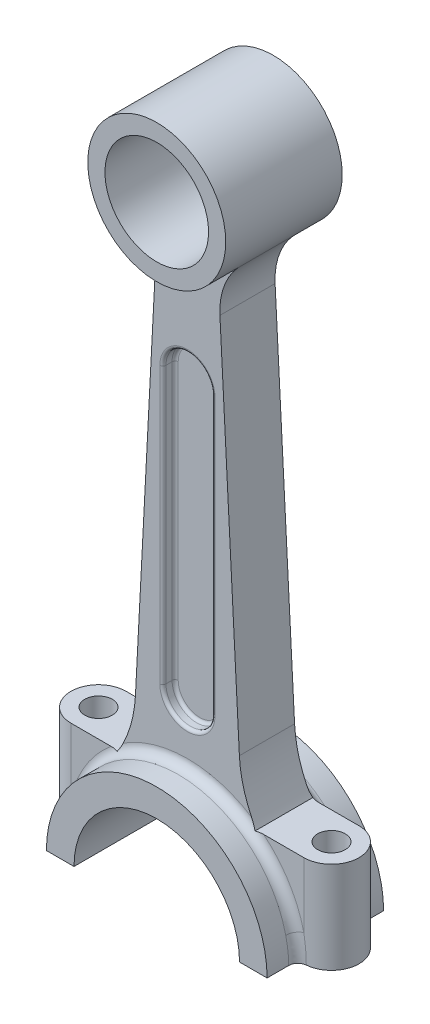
ISO-10303-21;
HEADER;
FILE_DESCRIPTION(('STEP AP214'),'2;1');
FILE_NAME('part.step','',(''),(''),'','','');
FILE_SCHEMA(('AUTOMOTIVE_DESIGN { 1 0 10303 214 1 1 1 1 }'));
ENDSEC;
DATA;
#1=APPLICATION_CONTEXT('core data for automotive mechanical design processes');
#2=APPLICATION_PROTOCOL_DEFINITION('international standard','automotive_design',2000,#1);
#3=PRODUCT_CONTEXT('',#1,'mechanical');
#4=PRODUCT('Part','Part','',(#3));
#5=PRODUCT_RELATED_PRODUCT_CATEGORY('part','',(#4));
#6=PRODUCT_DEFINITION_FORMATION('','',#4);
#7=PRODUCT_DEFINITION_CONTEXT('part definition',#1,'design');
#8=PRODUCT_DEFINITION('design','',#6,#7);
#9=PRODUCT_DEFINITION_SHAPE('','',#8);
#10=(LENGTH_UNIT() NAMED_UNIT(*) SI_UNIT(.MILLI.,.METRE.));
#11=(NAMED_UNIT(*) PLANE_ANGLE_UNIT() SI_UNIT($,.RADIAN.));
#12=(NAMED_UNIT(*) SI_UNIT($,.STERADIAN.) SOLID_ANGLE_UNIT());
#13=UNCERTAINTY_MEASURE_WITH_UNIT(LENGTH_MEASURE(1.E-05),#10,'distance_accuracy_value','');
#14=(GEOMETRIC_REPRESENTATION_CONTEXT(3) GLOBAL_UNCERTAINTY_ASSIGNED_CONTEXT((#13)) GLOBAL_UNIT_ASSIGNED_CONTEXT((#10,
#11,#12)) REPRESENTATION_CONTEXT('',''));
#15=CARTESIAN_POINT('',(0.,0.,0.));
#16=DIRECTION('',(0.,0.,1.));
#17=DIRECTION('',(1.,0.,0.));
#18=AXIS2_PLACEMENT_3D('',#15,#16,#17);
#19=CARTESIAN_POINT('',(0.,0.,9.));
#20=DIRECTION('',(0.,0.,1.));
#21=DIRECTION('',(1.,0.,0.));
#22=AXIS2_PLACEMENT_3D('',#19,#20,#21);
#23=PLANE('',#22);
#24=DIRECTION('',(0.,1.,0.));
#25=VECTOR('',#24,1.);
#26=CARTESIAN_POINT('',(-38.,-296.907888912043,8.99999999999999));
#27=LINE('',#26,#25);
#28=CARTESIAN_POINT('',(-38.,-192.425035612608,8.99999999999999));
#29=VERTEX_POINT('',#28);
#30=CARTESIAN_POINT('',(-38.,-171.2,8.99999999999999));
#31=VERTEX_POINT('',#30);
#32=EDGE_CURVE('E351',#29,#31,#27,.T.);
#33=ORIENTED_EDGE('',*,*,#32,.F.);
#34=CARTESIAN_POINT('',(0.,-201.2,9.));
#35=DIRECTION('',(0.,0.,1.));
#36=DIRECTION('',(1.,0.,0.));
#37=AXIS2_PLACEMENT_3D('',#34,#35,#36);
#38=CIRCLE('',#37,39.);
#39=CARTESIAN_POINT('',(-24.9198715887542,-171.2,9.));
#40=VERTEX_POINT('',#39);
#41=EDGE_CURVE('E889',#29,#40,#38,.F.);
#42=ORIENTED_EDGE('',*,*,#41,.T.);
#43=DIRECTION('',(-1.,0.,0.));
#44=VECTOR('',#43,1.);
#45=CARTESIAN_POINT('',(-38.,-171.2,8.99999999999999));
#46=LINE('',#45,#44);
#47=EDGE_CURVE('E367',#40,#31,#46,.T.);
#48=ORIENTED_EDGE('',*,*,#47,.T.);
#49=EDGE_LOOP('',(#33,#42,#48));
#50=FACE_BOUND('',#49,.T.);
#51=ADVANCED_FACE('F49',(#50),#23,.T.);
#52=DIRECTION('',(0.,-1.,0.));
#53=VECTOR('',#52,1.);
#54=CARTESIAN_POINT('',(-8.99999999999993,-55.6,9.));
#55=LINE('',#54,#53);
#56=CARTESIAN_POINT('',(-8.99999999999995,-145.6,9.));
#57=VERTEX_POINT('',#56);
#58=CARTESIAN_POINT('',(-8.99999999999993,-55.6,9.));
#59=VERTEX_POINT('',#58);
#60=EDGE_CURVE('E560',#57,#59,#55,.F.);
#61=ORIENTED_EDGE('',*,*,#60,.T.);
#62=CARTESIAN_POINT('',(0.,-55.6,9.));
#63=DIRECTION('',(0.,0.,1.));
#64=DIRECTION('',(1.,0.,0.));
#65=AXIS2_PLACEMENT_3D('',#62,#63,#64);
#66=CIRCLE('',#65,8.99999999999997);
#67=CARTESIAN_POINT('',(9.,-55.6,9.));
#68=VERTEX_POINT('',#67);
#69=EDGE_CURVE('E569',#59,#68,#66,.F.);
#70=ORIENTED_EDGE('',*,*,#69,.T.);
#71=DIRECTION('',(0.,1.,0.));
#72=VECTOR('',#71,1.);
#73=CARTESIAN_POINT('',(8.99999999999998,-145.6,9.));
#74=LINE('',#73,#72);
#75=CARTESIAN_POINT('',(8.99999999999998,-145.6,9.));
#76=VERTEX_POINT('',#75);
#77=EDGE_CURVE('E566',#68,#76,#74,.F.);
#78=ORIENTED_EDGE('',*,*,#77,.T.);
#79=CARTESIAN_POINT('',(0.,-145.6,9.));
#80=DIRECTION('',(0.,0.,1.));
#81=DIRECTION('',(1.,0.,0.));
#82=AXIS2_PLACEMENT_3D('',#79,#80,#81);
#83=CIRCLE('',#82,8.99999999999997);
#84=EDGE_CURVE('E563',#76,#57,#83,.F.);
#85=ORIENTED_EDGE('',*,*,#84,.T.);
#86=EDGE_LOOP('',(#61,#70,#78,#85));
#87=FACE_BOUND('',#86,.T.);
#88=CARTESIAN_POINT('',(-56.9027580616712,-150.820677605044,9.));
#89=DIRECTION('',(0.,0.,1.));
#90=DIRECTION('',(1.,0.,0.));
#91=AXIS2_PLACEMENT_3D('',#88,#89,#90);
#92=CIRCLE('',#91,40.);
#93=CARTESIAN_POINT('',(-16.9575766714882,-152.914115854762,9.));
#94=VERTEX_POINT('',#93);
#95=CARTESIAN_POINT('',(-20.9156720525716,-168.282912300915,9.));
#96=VERTEX_POINT('',#95);
#97=EDGE_CURVE('E697',#94,#96,#92,.F.);
#98=ORIENTED_EDGE('',*,*,#97,.T.);
#99=CARTESIAN_POINT('',(0.,-201.2,9.));
#100=DIRECTION('',(0.,0.,1.));
#101=DIRECTION('',(1.,0.,0.));
#102=AXIS2_PLACEMENT_3D('',#99,#100,#101);
#103=CIRCLE('',#102,39.);
#104=CARTESIAN_POINT('',(20.9156720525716,-168.282912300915,9.));
#105=VERTEX_POINT('',#104);
#106=EDGE_CURVE('E882',#96,#105,#103,.F.);
#107=ORIENTED_EDGE('',*,*,#106,.T.);
#108=CARTESIAN_POINT('',(56.9027580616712,-150.820677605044,9.));
#109=DIRECTION('',(0.,0.,1.));
#110=DIRECTION('',(1.,0.,0.));
#111=AXIS2_PLACEMENT_3D('',#108,#109,#110);
#112=CIRCLE('',#111,40.);
#113=CARTESIAN_POINT('',(16.9575766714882,-152.914115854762,9.));
#114=VERTEX_POINT('',#113);
#115=EDGE_CURVE('E705',#105,#114,#112,.F.);
#116=ORIENTED_EDGE('',*,*,#115,.T.);
#117=DIRECTION('',(0.052335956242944,-0.998629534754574,0.));
#118=VECTOR('',#117,1.);
#119=CARTESIAN_POINT('',(8.91919021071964,0.467434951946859,9.));
#120=LINE('',#119,#118);
#121=CARTESIAN_POINT('',(10.6045909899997,-31.6919276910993,9.));
#122=VERTEX_POINT('',#121);
#123=EDGE_CURVE('E471',#122,#114,#120,.T.);
#124=ORIENTED_EDGE('',*,*,#123,.F.);
#125=CARTESIAN_POINT('',(33.0737555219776,-30.514368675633,9.));
#126=DIRECTION('',(0.,0.,1.));
#127=DIRECTION('',(1.,0.,0.));
#128=AXIS2_PLACEMENT_3D('',#125,#126,#127);
#129=CIRCLE('',#128,22.5);
#130=CARTESIAN_POINT('',(16.5368777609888,-15.2571843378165,9.));
#131=VERTEX_POINT('',#130);
#132=EDGE_CURVE('E683',#122,#131,#129,.F.);
#133=ORIENTED_EDGE('',*,*,#132,.T.);
#134=CARTESIAN_POINT('',(0.,0.,9.));
#135=DIRECTION('',(0.,0.,1.));
#136=DIRECTION('',(1.,0.,0.));
#137=AXIS2_PLACEMENT_3D('',#134,#135,#136);
#138=CIRCLE('',#137,22.5);
#139=CARTESIAN_POINT('',(-16.5368777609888,-15.2571843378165,9.));
#140=VERTEX_POINT('',#139);
#141=EDGE_CURVE('E463',#140,#131,#138,.T.);
#142=ORIENTED_EDGE('',*,*,#141,.F.);
#143=CARTESIAN_POINT('',(-33.0737555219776,-30.5143686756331,9.));
#144=DIRECTION('',(0.,0.,1.));
#145=DIRECTION('',(1.,0.,0.));
#146=AXIS2_PLACEMENT_3D('',#143,#144,#145);
#147=CIRCLE('',#146,22.5);
#148=CARTESIAN_POINT('',(-10.6045909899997,-31.6919276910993,9.));
#149=VERTEX_POINT('',#148);
#150=EDGE_CURVE('E677',#140,#149,#147,.F.);
#151=ORIENTED_EDGE('',*,*,#150,.T.);
#152=DIRECTION('',(-0.0523359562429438,-0.998629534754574,0.));
#153=VECTOR('',#152,1.);
#154=CARTESIAN_POINT('',(-8.91919021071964,0.467434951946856,9.));
#155=LINE('',#154,#153);
#156=EDGE_CURVE('E466',#149,#94,#155,.T.);
#157=ORIENTED_EDGE('',*,*,#156,.T.);
#158=EDGE_LOOP('',(#98,#107,#116,#124,#133,#142,#151,#157));
#159=FACE_BOUND('',#158,.T.);
#160=ADVANCED_FACE('F881',(#87,#159),#23,.T.);
#161=CARTESIAN_POINT('',(0.,0.,-9.));
#162=DIRECTION('',(0.,0.,1.));
#163=DIRECTION('',(1.,0.,0.));
#164=AXIS2_PLACEMENT_3D('',#161,#162,#163);
#165=PLANE('',#164);
#166=DIRECTION('',(0.,1.,0.));
#167=VECTOR('',#166,1.);
#168=CARTESIAN_POINT('',(38.,-296.907888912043,-8.99999999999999));
#169=LINE('',#168,#167);
#170=CARTESIAN_POINT('',(38.,-192.425035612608,-8.99999999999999));
#171=VERTEX_POINT('',#170);
#172=CARTESIAN_POINT('',(38.,-171.2,-8.99999999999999));
#173=VERTEX_POINT('',#172);
#174=EDGE_CURVE('E335',#171,#173,#169,.T.);
#175=ORIENTED_EDGE('',*,*,#174,.F.);
#176=CARTESIAN_POINT('',(0.,-201.2,-9.));
#177=DIRECTION('',(0.,0.,1.));
#178=DIRECTION('',(1.,0.,0.));
#179=AXIS2_PLACEMENT_3D('',#176,#177,#178);
#180=CIRCLE('',#179,39.);
#181=CARTESIAN_POINT('',(24.9198715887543,-171.2,-9.));
#182=VERTEX_POINT('',#181);
#183=EDGE_CURVE('E955',#171,#182,#180,.T.);
#184=ORIENTED_EDGE('',*,*,#183,.T.);
#185=DIRECTION('',(1.,0.,0.));
#186=VECTOR('',#185,1.);
#187=CARTESIAN_POINT('',(-38.,-171.2,-9.00000000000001));
#188=LINE('',#187,#186);
#189=EDGE_CURVE('E346',#182,#173,#188,.T.);
#190=ORIENTED_EDGE('',*,*,#189,.T.);
#191=EDGE_LOOP('',(#175,#184,#190));
#192=FACE_BOUND('',#191,.T.);
#193=ADVANCED_FACE('F971',(#192),#165,.F.);
#194=DIRECTION('',(0.,1.,0.));
#195=VECTOR('',#194,1.);
#196=CARTESIAN_POINT('',(9.,-55.6,-9.));
#197=LINE('',#196,#195);
#198=CARTESIAN_POINT('',(8.99999999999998,-145.6,-9.));
#199=VERTEX_POINT('',#198);
#200=CARTESIAN_POINT('',(9.,-55.6,-9.));
#201=VERTEX_POINT('',#200);
#202=EDGE_CURVE('E506',#199,#201,#197,.T.);
#203=ORIENTED_EDGE('',*,*,#202,.T.);
#204=CARTESIAN_POINT('',(0.,-55.6,-9.));
#205=DIRECTION('',(0.,0.,1.));
#206=DIRECTION('',(1.,0.,0.));
#207=AXIS2_PLACEMENT_3D('',#204,#205,#206);
#208=CIRCLE('',#207,8.99999999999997);
#209=CARTESIAN_POINT('',(-8.99999999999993,-55.6,-9.));
#210=VERTEX_POINT('',#209);
#211=EDGE_CURVE('E509',#201,#210,#208,.T.);
#212=ORIENTED_EDGE('',*,*,#211,.T.);
#213=DIRECTION('',(0.,-1.,0.));
#214=VECTOR('',#213,1.);
#215=CARTESIAN_POINT('',(-8.99999999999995,-145.6,-9.));
#216=LINE('',#215,#214);
#217=CARTESIAN_POINT('',(-8.99999999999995,-145.6,-9.));
#218=VERTEX_POINT('',#217);
#219=EDGE_CURVE('E494',#210,#218,#216,.T.);
#220=ORIENTED_EDGE('',*,*,#219,.T.);
#221=CARTESIAN_POINT('',(0.,-145.6,-9.));
#222=DIRECTION('',(0.,0.,1.));
#223=DIRECTION('',(1.,0.,0.));
#224=AXIS2_PLACEMENT_3D('',#221,#222,#223);
#225=CIRCLE('',#224,8.99999999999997);
#226=EDGE_CURVE('E503',#218,#199,#225,.T.);
#227=ORIENTED_EDGE('',*,*,#226,.T.);
#228=EDGE_LOOP('',(#203,#212,#220,#227));
#229=FACE_BOUND('',#228,.T.);
#230=CARTESIAN_POINT('',(56.9027580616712,-150.820677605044,-9.));
#231=DIRECTION('',(0.,0.,1.));
#232=DIRECTION('',(1.,0.,0.));
#233=AXIS2_PLACEMENT_3D('',#230,#231,#232);
#234=CIRCLE('',#233,40.);
#235=CARTESIAN_POINT('',(16.9575766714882,-152.914115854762,-9.));
#236=VERTEX_POINT('',#235);
#237=CARTESIAN_POINT('',(20.9156720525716,-168.282912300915,-9.));
#238=VERTEX_POINT('',#237);
#239=EDGE_CURVE('E701',#236,#238,#234,.T.);
#240=ORIENTED_EDGE('',*,*,#239,.T.);
#241=CARTESIAN_POINT('',(0.,-201.2,-9.));
#242=DIRECTION('',(0.,0.,1.));
#243=DIRECTION('',(1.,0.,0.));
#244=AXIS2_PLACEMENT_3D('',#241,#242,#243);
#245=CIRCLE('',#244,39.);
#246=CARTESIAN_POINT('',(-20.9156720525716,-168.282912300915,-9.));
#247=VERTEX_POINT('',#246);
#248=EDGE_CURVE('E958',#238,#247,#245,.T.);
#249=ORIENTED_EDGE('',*,*,#248,.T.);
#250=CARTESIAN_POINT('',(-56.9027580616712,-150.820677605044,-9.));
#251=DIRECTION('',(0.,0.,1.));
#252=DIRECTION('',(1.,0.,0.));
#253=AXIS2_PLACEMENT_3D('',#250,#251,#252);
#254=CIRCLE('',#253,40.);
#255=CARTESIAN_POINT('',(-16.9575766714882,-152.914115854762,-9.));
#256=VERTEX_POINT('',#255);
#257=EDGE_CURVE('E694',#247,#256,#254,.T.);
#258=ORIENTED_EDGE('',*,*,#257,.T.);
#259=DIRECTION('',(-0.0523359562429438,-0.998629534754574,0.));
#260=VECTOR('',#259,1.);
#261=CARTESIAN_POINT('',(-8.91919021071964,0.467434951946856,-9.));
#262=LINE('',#261,#260);
#263=CARTESIAN_POINT('',(-10.6045909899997,-31.6919276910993,-9.));
#264=VERTEX_POINT('',#263);
#265=EDGE_CURVE('E478',#264,#256,#262,.T.);
#266=ORIENTED_EDGE('',*,*,#265,.F.);
#267=CARTESIAN_POINT('',(-33.0737555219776,-30.5143686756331,-9.));
#268=DIRECTION('',(0.,0.,1.));
#269=DIRECTION('',(1.,0.,0.));
#270=AXIS2_PLACEMENT_3D('',#267,#268,#269);
#271=CIRCLE('',#270,22.5);
#272=CARTESIAN_POINT('',(-16.5368777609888,-15.2571843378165,-9.));
#273=VERTEX_POINT('',#272);
#274=EDGE_CURVE('E673',#264,#273,#271,.T.);
#275=ORIENTED_EDGE('',*,*,#274,.T.);
#276=CARTESIAN_POINT('',(0.,0.,-9.));
#277=DIRECTION('',(0.,0.,1.));
#278=DIRECTION('',(1.,0.,0.));
#279=AXIS2_PLACEMENT_3D('',#276,#277,#278);
#280=CIRCLE('',#279,22.5);
#281=CARTESIAN_POINT('',(16.5368777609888,-15.2571843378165,-9.));
#282=VERTEX_POINT('',#281);
#283=EDGE_CURVE('E462',#273,#282,#280,.T.);
#284=ORIENTED_EDGE('',*,*,#283,.T.);
#285=CARTESIAN_POINT('',(33.0737555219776,-30.514368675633,-9.));
#286=DIRECTION('',(0.,0.,1.));
#287=DIRECTION('',(1.,0.,0.));
#288=AXIS2_PLACEMENT_3D('',#285,#286,#287);
#289=CIRCLE('',#288,22.5);
#290=CARTESIAN_POINT('',(10.6045909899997,-31.6919276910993,-9.));
#291=VERTEX_POINT('',#290);
#292=EDGE_CURVE('E680',#282,#291,#289,.T.);
#293=ORIENTED_EDGE('',*,*,#292,.T.);
#294=DIRECTION('',(0.052335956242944,-0.998629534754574,0.));
#295=VECTOR('',#294,1.);
#296=CARTESIAN_POINT('',(8.91919021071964,0.467434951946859,-9.));
#297=LINE('',#296,#295);
#298=EDGE_CURVE('E467',#291,#236,#297,.T.);
#299=ORIENTED_EDGE('',*,*,#298,.T.);
#300=EDGE_LOOP('',(#240,#249,#258,#266,#275,#284,#293,#299));
#301=FACE_BOUND('',#300,.T.);
#302=ADVANCED_FACE('F1177',(#229,#301),#165,.F.);
#303=CARTESIAN_POINT('',(0.,-201.2,19.));
#304=DIRECTION('',(0.,1.,0.));
#305=DIRECTION('',(0.,0.,1.));
#306=AXIS2_PLACEMENT_3D('',#303,#304,#305);
#307=PLANE('',#306);
#308=CARTESIAN_POINT('',(-38.,-201.2,0.));
#309=DIRECTION('',(0.,1.,0.));
#310=DIRECTION('',(0.,0.,-1.));
#311=AXIS2_PLACEMENT_3D('',#308,#309,#310);
#312=CIRCLE('',#311,4.5);
#313=CARTESIAN_POINT('',(-38.,-201.2,-4.50000000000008));
#314=VERTEX_POINT('',#313);
#315=EDGE_CURVE('E990',#314,#314,#312,.T.);
#316=ORIENTED_EDGE('',*,*,#315,.T.);
#317=EDGE_LOOP('',(#316));
#318=FACE_BOUND('',#317,.T.);
#319=DIRECTION('',(1.,0.,0.));
#320=VECTOR('',#319,1.);
#321=CARTESIAN_POINT('',(0.,-201.2,-19.));
#322=LINE('',#321,#320);
#323=CARTESIAN_POINT('',(-36.,-201.2,-19.));
#324=VERTEX_POINT('',#323);
#325=CARTESIAN_POINT('',(-27.,-201.2,-19.));
#326=VERTEX_POINT('',#325);
#327=EDGE_CURVE('E436',#324,#326,#322,.T.);
#328=ORIENTED_EDGE('',*,*,#327,.T.);
#329=DIRECTION('',(0.,0.,-1.));
#330=VECTOR('',#329,1.);
#331=CARTESIAN_POINT('',(-27.,-201.2,19.));
#332=LINE('',#331,#330);
#333=CARTESIAN_POINT('',(-27.,-201.2,19.));
#334=VERTEX_POINT('',#333);
#335=EDGE_CURVE('E454',#334,#326,#332,.T.);
#336=ORIENTED_EDGE('',*,*,#335,.F.);
#337=DIRECTION('',(1.,0.,0.));
#338=VECTOR('',#337,1.);
#339=CARTESIAN_POINT('',(0.,-201.2,19.));
#340=LINE('',#339,#338);
#341=CARTESIAN_POINT('',(-36.,-201.2,19.));
#342=VERTEX_POINT('',#341);
#343=EDGE_CURVE('E421',#342,#334,#340,.T.);
#344=ORIENTED_EDGE('',*,*,#343,.F.);
#345=DIRECTION('',(0.,0.,-1.));
#346=VECTOR('',#345,1.);
#347=CARTESIAN_POINT('',(-36.,-201.2,19.));
#348=LINE('',#347,#346);
#349=CARTESIAN_POINT('',(-36.,-201.2,11.9582607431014));
#350=VERTEX_POINT('',#349);
#351=EDGE_CURVE('E458',#342,#350,#348,.T.);
#352=ORIENTED_EDGE('',*,*,#351,.T.);
#353=CARTESIAN_POINT('',(-39.,-201.2,11.9582607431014));
#354=DIRECTION('',(0.,1.,0.));
#355=DIRECTION('',(0.,0.,1.));
#356=AXIS2_PLACEMENT_3D('',#353,#354,#355);
#357=CIRCLE('',#356,3.);
#358=CARTESIAN_POINT('',(-38.75,-201.2,8.96869555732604));
#359=VERTEX_POINT('',#358);
#360=EDGE_CURVE('E867',#350,#359,#357,.T.);
#361=ORIENTED_EDGE('',*,*,#360,.T.);
#362=CARTESIAN_POINT('',(-38.,-201.2,0.));
#363=DIRECTION('',(0.,1.,0.));
#364=DIRECTION('',(0.,0.,1.));
#365=AXIS2_PLACEMENT_3D('',#362,#363,#364);
#366=CIRCLE('',#365,9.);
#367=CARTESIAN_POINT('',(-38.75,-201.2,-8.96869555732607));
#368=VERTEX_POINT('',#367);
#369=EDGE_CURVE('E361',#368,#359,#366,.T.);
#370=ORIENTED_EDGE('',*,*,#369,.F.);
#371=CARTESIAN_POINT('',(-39.,-201.2,-11.9582607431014));
#372=DIRECTION('',(0.,1.,0.));
#373=DIRECTION('',(0.,0.,1.));
#374=AXIS2_PLACEMENT_3D('',#371,#372,#373);
#375=CIRCLE('',#374,3.);
#376=CARTESIAN_POINT('',(-36.,-201.2,-11.9582607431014));
#377=VERTEX_POINT('',#376);
#378=EDGE_CURVE('E862',#368,#377,#375,.T.);
#379=ORIENTED_EDGE('',*,*,#378,.T.);
#380=EDGE_CURVE('E457',#377,#324,#348,.T.);
#381=ORIENTED_EDGE('',*,*,#380,.T.);
#382=EDGE_LOOP('',(#328,#336,#344,#352,#361,#370,#379,#381));
#383=FACE_BOUND('',#382,.T.);
#384=ADVANCED_FACE('F1069',(#318,#383),#307,.F.);
#385=CARTESIAN_POINT('',(0.,-201.2,19.));
#386=DIRECTION('',(0.,0.,-1.));
#387=DIRECTION('',(-1.,0.,0.));
#388=AXIS2_PLACEMENT_3D('',#385,#386,#387);
#389=CYLINDRICAL_SURFACE('',#388,36.);
#390=DIRECTION('',(0.,0.,-1.));
#391=VECTOR('',#390,1.);
#392=CARTESIAN_POINT('',(36.,-201.2,19.));
#393=LINE('',#392,#391);
#394=CARTESIAN_POINT('',(36.,-201.2,19.));
#395=VERTEX_POINT('',#394);
#396=CARTESIAN_POINT('',(36.,-201.2,11.9582607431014));
#397=VERTEX_POINT('',#396);
#398=EDGE_CURVE('E447',#395,#397,#393,.T.);
#399=ORIENTED_EDGE('',*,*,#398,.T.);
#400=CARTESIAN_POINT('',(37.4810325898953,-189.837346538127,8.98502492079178));
#401=CARTESIAN_POINT('',(34.4537354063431,-190.762425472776,8.81017080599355));
#402=CARTESIAN_POINT('',(34.4381939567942,-190.711396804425,11.9800332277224));
#403=CARTESIAN_POINT('',(37.5298969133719,-190.051266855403,8.98784608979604));
#404=CARTESIAN_POINT('',(34.5115894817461,-190.953422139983,8.82998687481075));
#405=CARTESIAN_POINT('',(34.498334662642,-190.908861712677,11.9837947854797));
#406=CARTESIAN_POINT('',(37.577382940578,-190.265756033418,8.99019014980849));
#407=CARTESIAN_POINT('',(34.5681739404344,-191.145960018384,8.84874261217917));
#408=CARTESIAN_POINT('',(34.556779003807,-191.106851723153,11.9869201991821));
#409=CARTESIAN_POINT('',(37.6695772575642,-190.69577517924,8.99405103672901));
#410=CARTESIAN_POINT('',(34.678332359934,-191.532819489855,8.88416835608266));
#411=CARTESIAN_POINT('',(34.6702489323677,-191.503792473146,11.9920680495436));
#412=CARTESIAN_POINT('',(37.7142859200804,-190.911305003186,8.99556797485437));
#413=CARTESIAN_POINT('',(34.7319378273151,-191.72718784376,8.9008542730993));
#414=CARTESIAN_POINT('',(34.7252749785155,-191.702743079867,11.9940906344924));
#415=CARTESIAN_POINT('',(37.8007754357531,-191.342657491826,8.99789846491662));
#416=CARTESIAN_POINT('',(34.8358867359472,-192.116960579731,8.93226168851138));
#417=CARTESIAN_POINT('',(34.8317236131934,-192.100914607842,11.9971979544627));
#418=CARTESIAN_POINT('',(37.8425654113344,-191.558476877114,8.99871430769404));
#419=CARTESIAN_POINT('',(34.8862690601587,-192.312405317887,8.94700271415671));
#420=CARTESIAN_POINT('',(34.8831574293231,-192.300132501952,11.9982857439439));
#421=CARTESIAN_POINT('',(37.923368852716,-191.991060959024,8.99976377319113));
#422=CARTESIAN_POINT('',(34.9838968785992,-192.70483665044,8.97474421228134));
#423=CARTESIAN_POINT('',(34.9826078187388,-192.699440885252,11.9996850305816));
#424=CARTESIAN_POINT('',(37.9623819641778,-192.207825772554,8.99999732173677));
#425=CARTESIAN_POINT('',(35.0311700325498,-192.901874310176,8.98775615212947));
#426=CARTESIAN_POINT('',(35.0306239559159,-192.899531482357,11.9999964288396));
#427=CARTESIAN_POINT('',(38.170169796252,-193.407610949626,9.00001211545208));
#428=CARTESIAN_POINT('',(35.2815859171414,-193.986437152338,9.0547692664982));
#429=CARTESIAN_POINT('',(35.2863628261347,-194.007025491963,12.0000161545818));
#430=CARTESIAN_POINT('',(38.3117919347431,-194.399292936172,8.99529989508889));
#431=CARTESIAN_POINT('',(35.4565715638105,-194.898702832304,9.09435648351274));
#432=CARTESIAN_POINT('',(35.4606669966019,-194.922424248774,11.9937331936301));
#433=CARTESIAN_POINT('',(38.5370044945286,-196.394827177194,8.98467632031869));
#434=CARTESIAN_POINT('',(35.7342965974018,-196.737374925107,9.15229240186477));
#435=CARTESIAN_POINT('',(35.7378516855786,-196.764455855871,11.9795684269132));
#436=CARTESIAN_POINT('',(38.620559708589,-197.398686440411,8.97876424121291));
#437=CARTESIAN_POINT('',(35.8386966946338,-197.669222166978,9.17105709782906));
#438=CARTESIAN_POINT('',(35.8406888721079,-197.691095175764,11.9716856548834));
#439=CARTESIAN_POINT('',(38.7023265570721,-198.916041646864,8.97258744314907));
#440=CARTESIAN_POINT('',(35.9405679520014,-199.078234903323,9.18876896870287));
#441=CARTESIAN_POINT('',(35.9413249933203,-199.091730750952,11.9634499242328));
#442=CARTESIAN_POINT('',(38.7223028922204,-199.427577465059,8.97097540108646));
#443=CARTESIAN_POINT('',(35.9654791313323,-199.553437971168,9.1929437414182));
#444=CARTESIAN_POINT('',(35.9659112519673,-199.563917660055,11.9613005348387));
#445=CARTESIAN_POINT('',(38.7471320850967,-200.451338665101,8.96894546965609));
#446=CARTESIAN_POINT('',(35.9964090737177,-200.504156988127,9.19808791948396));
#447=CARTESIAN_POINT('',(35.9964702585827,-200.508927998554,11.9585939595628));
#448=CARTESIAN_POINT('',(38.7519847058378,-200.963564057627,8.96852759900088));
#449=CARTESIAN_POINT('',(36.0024767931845,-200.980428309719,9.19906554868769));
#450=CARTESIAN_POINT('',(36.0024427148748,-200.981751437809,11.958036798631));
#451=CARTESIAN_POINT('',(38.7465546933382,-201.987617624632,8.96898559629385));
#452=CARTESIAN_POINT('',(35.9957015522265,-201.931749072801,9.19795969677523));
#453=CARTESIAN_POINT('',(35.9957596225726,-201.927031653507,11.9586474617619));
#454=CARTESIAN_POINT('',(38.7362793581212,-202.499445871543,8.96986084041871));
#455=CARTESIAN_POINT('',(35.9828569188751,-202.407556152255,9.19587593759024));
#456=CARTESIAN_POINT('',(35.9831130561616,-202.399488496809,11.9598144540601));
#457=CARTESIAN_POINT('',(38.7006289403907,-203.522155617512,8.97269456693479));
#458=CARTESIAN_POINT('',(35.9384938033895,-203.356926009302,9.18837599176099));
#459=CARTESIAN_POINT('',(35.9392356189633,-203.343528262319,11.9635927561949));
#460=CARTESIAN_POINT('',(38.6752540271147,-204.033037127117,8.97465303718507));
#461=CARTESIAN_POINT('',(35.9069050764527,-203.831240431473,9.1829476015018));
#462=CARTESIAN_POINT('',(35.9080049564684,-203.815111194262,11.9662040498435));
#463=CARTESIAN_POINT('',(38.6423403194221,-204.543052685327,8.97704845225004));
#464=CARTESIAN_POINT('',(35.8660269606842,-204.302966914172,9.17570372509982));
#465=CARTESIAN_POINT('',(35.8674957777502,-204.285894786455,11.9693979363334));
#466=(BOUNDED_SURFACE() B_SPLINE_SURFACE(3,2,((#400,#401,#402),(#403,#404,#405),(#406,#407,
#408),(#409,#410,#411),(#412,#413,#414),(#415,#416,#417),(#418,#419,#420),(#421,#422,#423),
(#424,#425,#426),(#427,#428,#429),(#430,#431,#432),(#433,#434,#435),(#436,#437,#438),(#439,#440,
#441),(#442,#443,#444),(#445,#446,#447),(#448,#449,#450),(#451,#452,#453),(#454,#455,#456),
(#457,#458,#459),(#460,#461,#462),(#463,#464,#465)),.UNSPECIFIED.,.F.,.F.,
.F.) B_SPLINE_SURFACE_WITH_KNOTS((4,2,2,2,2,2,2,2,2,2,4),(3,3),(0.,0.670947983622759,
1.3418057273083,2.01046300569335,2.67920545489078,5.70434389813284,8.73131495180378,
10.2676745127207,11.8040581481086,13.3397008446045,14.875326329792),(0.,1.),
.UNSPECIFIED.) GEOMETRIC_REPRESENTATION_ITEM() RATIONAL_B_SPLINE_SURFACE(((1.,0.687327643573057,
1.),(1.,0.689181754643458,1.),(1.,0.690985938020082,1.),(1.,0.694492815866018,1.),(1.,
0.696195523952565,1.),(1.,0.699492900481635,1.),(1.,0.70108790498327,1.),(1.,0.704174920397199,
1.),(1.,0.705666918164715,1.),(1.,0.713620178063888,1.),(1.,0.719066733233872,1.),(1.,
0.727743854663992,1.),(1.,0.730973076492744,1.),(1.,0.734135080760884,1.),(1.,0.734908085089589,
1.),(1.,0.735869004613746,1.),(1.,0.736056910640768,1.),(1.,0.735846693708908,1.),(1.,
0.735448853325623,1.),(1.,0.734069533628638,1.),(1.,0.733088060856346,1.),(1.,0.731815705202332,1.))) REPRESENTATION_ITEM('') SURFACE());
#467=CARTESIAN_POINT('',(35.8674957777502,-204.285894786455,11.9693979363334));
#468=CARTESIAN_POINT('',(35.9080049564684,-203.815111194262,11.9662040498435));
#469=CARTESIAN_POINT('',(35.9392356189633,-203.343528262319,11.9635927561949));
#470=CARTESIAN_POINT('',(35.9831130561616,-202.399488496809,11.9598144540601));
#471=CARTESIAN_POINT('',(35.9957596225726,-201.927031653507,11.9586474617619));
#472=CARTESIAN_POINT('',(36.0024427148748,-200.981751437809,11.958036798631));
#473=CARTESIAN_POINT('',(35.9964702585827,-200.508927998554,11.9585939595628));
#474=CARTESIAN_POINT('',(35.9659112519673,-199.563917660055,11.9613005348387));
#475=CARTESIAN_POINT('',(35.9413249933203,-199.091730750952,11.9634499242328));
#476=CARTESIAN_POINT('',(35.8406888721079,-197.691095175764,11.9716856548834));
#477=CARTESIAN_POINT('',(35.7378516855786,-196.764455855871,11.9795684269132));
#478=CARTESIAN_POINT('',(35.4606669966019,-194.922424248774,11.9937331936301));
#479=CARTESIAN_POINT('',(35.2863628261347,-194.007025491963,12.0000161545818));
#480=CARTESIAN_POINT('',(35.0306239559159,-192.899531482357,11.9999964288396));
#481=CARTESIAN_POINT('',(34.9826078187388,-192.699440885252,11.9996850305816));
#482=CARTESIAN_POINT('',(34.8831574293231,-192.300132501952,11.9982857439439));
#483=CARTESIAN_POINT('',(34.8317236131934,-192.100914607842,11.9971979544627));
#484=CARTESIAN_POINT('',(34.7252749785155,-191.702743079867,11.9940906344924));
#485=CARTESIAN_POINT('',(34.6702489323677,-191.503792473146,11.9920680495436));
#486=CARTESIAN_POINT('',(34.556779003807,-191.106851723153,11.9869201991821));
#487=CARTESIAN_POINT('',(34.498334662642,-190.908861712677,11.9837947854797));
#488=CARTESIAN_POINT('',(34.4381939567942,-190.711396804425,11.9800332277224));
#489=B_SPLINE_CURVE_WITH_KNOTS('',3,(#467,#468,#469,#470,#471,#472,#473,#474,#475,#476,#477,
#478,#479,#480,#481,#482,#483,#484,#485,#486,#487,#488),.UNSPECIFIED.,.F.,.F.,(4,2,2,2,2,2,2,2,
2,2,4),(0.,1.53562548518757,3.07126818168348,4.60765181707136,6.14401137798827,9.17098243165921,
12.1961208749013,12.8648633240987,13.5335206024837,14.2043783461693,14.875326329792),.UNSPECIFIED.);
#490=CARTESIAN_POINT('',(35.0769230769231,-193.100032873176,12.));
#491=VERTEX_POINT('',#490);
#492=EDGE_CURVE('E894',#397,#491,#489,.T.);
#493=ORIENTED_EDGE('',*,*,#492,.T.);
#494=CARTESIAN_POINT('',(0.,-201.2,12.));
#495=DIRECTION('',(0.,0.,1.));
#496=DIRECTION('',(1.,0.,0.));
#497=AXIS2_PLACEMENT_3D('',#494,#495,#496);
#498=CIRCLE('',#497,36.);
#499=CARTESIAN_POINT('',(-35.0769230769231,-193.100032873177,12.));
#500=VERTEX_POINT('',#499);
#501=EDGE_CURVE('E904',#491,#500,#498,.T.);
#502=ORIENTED_EDGE('',*,*,#501,.T.);
#503=CARTESIAN_POINT('',(-34.4381939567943,-190.711396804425,11.9800332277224));
#504=CARTESIAN_POINT('',(-34.4537354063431,-190.762425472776,8.81017080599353));
#505=CARTESIAN_POINT('',(-37.4810325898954,-189.837346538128,8.98502492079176));
#506=CARTESIAN_POINT('',(-34.498334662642,-190.908861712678,11.9837947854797));
#507=CARTESIAN_POINT('',(-34.5115894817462,-190.953422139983,8.82998687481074));
#508=CARTESIAN_POINT('',(-37.5298969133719,-190.051266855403,8.98784608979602));
#509=CARTESIAN_POINT('',(-34.5567790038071,-191.106851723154,11.9869201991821));
#510=CARTESIAN_POINT('',(-34.5681739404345,-191.145960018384,8.84874261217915));
#511=CARTESIAN_POINT('',(-37.577382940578,-190.265756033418,8.99019014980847));
#512=CARTESIAN_POINT('',(-34.6702489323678,-191.503792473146,11.9920680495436));
#513=CARTESIAN_POINT('',(-34.678332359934,-191.532819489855,8.88416835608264));
#514=CARTESIAN_POINT('',(-37.6695772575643,-190.695775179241,8.99405103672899));
#515=CARTESIAN_POINT('',(-34.7252749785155,-191.702743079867,11.9940906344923));
#516=CARTESIAN_POINT('',(-34.7319378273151,-191.72718784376,8.90085427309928));
#517=CARTESIAN_POINT('',(-37.7142859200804,-190.911305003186,8.99556797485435));
#518=CARTESIAN_POINT('',(-34.8317236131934,-192.100914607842,11.9971979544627));
#519=CARTESIAN_POINT('',(-34.8358867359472,-192.116960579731,8.93226168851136));
#520=CARTESIAN_POINT('',(-37.8007754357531,-191.342657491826,8.9978984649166));
#521=CARTESIAN_POINT('',(-34.8831574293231,-192.300132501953,11.9982857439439));
#522=CARTESIAN_POINT('',(-34.8862690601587,-192.312405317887,8.94700271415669));
#523=CARTESIAN_POINT('',(-37.8425654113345,-191.558476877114,8.99871430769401));
#524=CARTESIAN_POINT('',(-34.9826078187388,-192.699440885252,11.9996850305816));
#525=CARTESIAN_POINT('',(-34.9838968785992,-192.70483665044,8.97474421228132));
#526=CARTESIAN_POINT('',(-37.923368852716,-191.991060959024,8.9997637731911));
#527=CARTESIAN_POINT('',(-35.0306239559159,-192.899531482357,11.9999964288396));
#528=CARTESIAN_POINT('',(-35.0311700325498,-192.901874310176,8.98775615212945));
#529=CARTESIAN_POINT('',(-37.9623819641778,-192.207825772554,8.99999732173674));
#530=CARTESIAN_POINT('',(-35.2863628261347,-194.007025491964,12.0000161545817));
#531=CARTESIAN_POINT('',(-35.2815859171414,-193.986437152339,9.05476926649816));
#532=CARTESIAN_POINT('',(-38.170169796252,-193.407610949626,9.00001211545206));
#533=CARTESIAN_POINT('',(-35.4606669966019,-194.922424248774,11.9937331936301));
#534=CARTESIAN_POINT('',(-35.4565715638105,-194.898702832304,9.09435648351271));
#535=CARTESIAN_POINT('',(-38.3117919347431,-194.399292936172,8.99529989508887));
#536=CARTESIAN_POINT('',(-35.7378516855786,-196.764455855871,11.9795684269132));
#537=CARTESIAN_POINT('',(-35.7342965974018,-196.737374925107,9.15229240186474));
#538=CARTESIAN_POINT('',(-38.5370044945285,-196.394827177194,8.98467632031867));
#539=CARTESIAN_POINT('',(-35.8406888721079,-197.691095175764,11.9716856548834));
#540=CARTESIAN_POINT('',(-35.8386966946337,-197.669222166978,9.17105709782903));
#541=CARTESIAN_POINT('',(-38.620559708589,-197.398686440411,8.97876424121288));
#542=CARTESIAN_POINT('',(-35.9413249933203,-199.091730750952,11.9634499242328));
#543=CARTESIAN_POINT('',(-35.9405679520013,-199.078234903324,9.18876896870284));
#544=CARTESIAN_POINT('',(-38.7023265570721,-198.916041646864,8.97258744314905));
#545=CARTESIAN_POINT('',(-35.9659112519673,-199.563917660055,11.9613005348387));
#546=CARTESIAN_POINT('',(-35.9654791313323,-199.553437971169,9.19294374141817));
#547=CARTESIAN_POINT('',(-38.7223028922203,-199.427577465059,8.97097540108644));
#548=CARTESIAN_POINT('',(-35.9964702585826,-200.508927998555,11.9585939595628));
#549=CARTESIAN_POINT('',(-35.9964090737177,-200.504156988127,9.19808791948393));
#550=CARTESIAN_POINT('',(-38.7471320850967,-200.451338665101,8.96894546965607));
#551=CARTESIAN_POINT('',(-36.0024427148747,-200.981751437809,11.958036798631));
#552=CARTESIAN_POINT('',(-36.0024767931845,-200.980428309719,9.19906554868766));
#553=CARTESIAN_POINT('',(-38.7519847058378,-200.963564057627,8.96852759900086));
#554=CARTESIAN_POINT('',(-35.9957596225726,-201.927031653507,11.9586474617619));
#555=CARTESIAN_POINT('',(-35.9957015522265,-201.931749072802,9.1979596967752));
#556=CARTESIAN_POINT('',(-38.7465546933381,-201.987617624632,8.96898559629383));
#557=CARTESIAN_POINT('',(-35.9831130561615,-202.399488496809,11.9598144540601));
#558=CARTESIAN_POINT('',(-35.982856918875,-202.407556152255,9.1958759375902));
#559=CARTESIAN_POINT('',(-38.7362793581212,-202.499445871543,8.9698608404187));
#560=CARTESIAN_POINT('',(-35.9392356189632,-203.343528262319,11.9635927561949));
#561=CARTESIAN_POINT('',(-35.9384938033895,-203.356926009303,9.18837599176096));
#562=CARTESIAN_POINT('',(-38.7006289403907,-203.522155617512,8.97269456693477));
#563=CARTESIAN_POINT('',(-35.9080049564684,-203.815111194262,11.9662040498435));
#564=CARTESIAN_POINT('',(-35.9069050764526,-203.831240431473,9.18294760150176));
#565=CARTESIAN_POINT('',(-38.6752540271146,-204.033037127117,8.97465303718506));
#566=CARTESIAN_POINT('',(-35.8674957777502,-204.285894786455,11.9693979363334));
#567=CARTESIAN_POINT('',(-35.8660269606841,-204.302966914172,9.17570372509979));
#568=CARTESIAN_POINT('',(-38.642340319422,-204.543052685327,8.97704845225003));
#569=(BOUNDED_SURFACE() B_SPLINE_SURFACE(3,2,((#503,#504,#505),(#506,#507,#508),(#509,#510,
#511),(#512,#513,#514),(#515,#516,#517),(#518,#519,#520),(#521,#522,#523),(#524,#525,#526),
(#527,#528,#529),(#530,#531,#532),(#533,#534,#535),(#536,#537,#538),(#539,#540,#541),(#542,#543,
#544),(#545,#546,#547),(#548,#549,#550),(#551,#552,#553),(#554,#555,#556),(#557,#558,#559),
(#560,#561,#562),(#563,#564,#565),(#566,#567,#568)),.UNSPECIFIED.,.F.,.F.,
.F.) B_SPLINE_SURFACE_WITH_KNOTS((4,2,2,2,2,2,2,2,2,2,4),(3,3),(0.,0.670947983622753,
1.3418057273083,2.01046300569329,2.67920545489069,5.70434389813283,8.73131495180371,
10.2676745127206,11.8040581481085,13.3397008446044,14.875326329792),(0.,1.),
.UNSPECIFIED.) GEOMETRIC_REPRESENTATION_ITEM() RATIONAL_B_SPLINE_SURFACE(((1.,0.687327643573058,
1.),(1.,0.689181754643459,1.),(1.,0.690985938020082,1.),(1.,0.694492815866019,1.),(1.,
0.696195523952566,1.),(1.,0.699492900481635,1.),(1.,0.701087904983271,1.),(1.,0.7041749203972,
1.),(1.,0.705666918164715,1.),(1.,0.713620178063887,1.),(1.,0.719066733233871,1.),(1.,
0.727743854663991,1.),(1.,0.730973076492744,1.),(1.,0.734135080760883,1.),(1.,0.734908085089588,
1.),(1.,0.735869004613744,1.),(1.,0.736056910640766,1.),(1.,0.735846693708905,1.),(1.,
0.735448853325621,1.),(1.,0.734069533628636,1.),(1.,0.733088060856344,1.),(1.,0.731815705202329,1.))) REPRESENTATION_ITEM('') SURFACE());
#570=CARTESIAN_POINT('',(-34.4381939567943,-190.711396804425,11.9800332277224));
#571=CARTESIAN_POINT('',(-34.498334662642,-190.908861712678,11.9837947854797));
#572=CARTESIAN_POINT('',(-34.5567790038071,-191.106851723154,11.9869201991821));
#573=CARTESIAN_POINT('',(-34.6702489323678,-191.503792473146,11.9920680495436));
#574=CARTESIAN_POINT('',(-34.7252749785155,-191.702743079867,11.9940906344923));
#575=CARTESIAN_POINT('',(-34.8317236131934,-192.100914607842,11.9971979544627));
#576=CARTESIAN_POINT('',(-34.8831574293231,-192.300132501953,11.9982857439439));
#577=CARTESIAN_POINT('',(-34.9826078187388,-192.699440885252,11.9996850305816));
#578=CARTESIAN_POINT('',(-35.0306239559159,-192.899531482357,11.9999964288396));
#579=CARTESIAN_POINT('',(-35.2863628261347,-194.007025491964,12.0000161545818));
#580=CARTESIAN_POINT('',(-35.4606669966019,-194.922424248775,11.9937331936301));
#581=CARTESIAN_POINT('',(-35.7378516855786,-196.764455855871,11.9795684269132));
#582=CARTESIAN_POINT('',(-35.8406888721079,-197.691095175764,11.9716856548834));
#583=CARTESIAN_POINT('',(-35.9413249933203,-199.091730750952,11.9634499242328));
#584=CARTESIAN_POINT('',(-35.9659112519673,-199.563917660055,11.9613005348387));
#585=CARTESIAN_POINT('',(-35.9964702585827,-200.508927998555,11.9585939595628));
#586=CARTESIAN_POINT('',(-36.0024427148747,-200.981751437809,11.958036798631));
#587=CARTESIAN_POINT('',(-35.9957596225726,-201.927031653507,11.9586474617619));
#588=CARTESIAN_POINT('',(-35.9831130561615,-202.399488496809,11.9598144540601));
#589=CARTESIAN_POINT('',(-35.9392356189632,-203.343528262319,11.9635927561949));
#590=CARTESIAN_POINT('',(-35.9080049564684,-203.815111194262,11.9662040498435));
#591=CARTESIAN_POINT('',(-35.8674957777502,-204.285894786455,11.9693979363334));
#592=B_SPLINE_CURVE_WITH_KNOTS('',3,(#570,#571,#572,#573,#574,#575,#576,#577,#578,#579,#580,
#581,#582,#583,#584,#585,#586,#587,#588,#589,#590,#591),.UNSPECIFIED.,.F.,.F.,(4,2,2,2,2,2,2,2,
2,2,4),(0.,0.670947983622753,1.3418057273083,2.01046300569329,2.67920545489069,5.70434389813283,
8.73131495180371,10.2676745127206,11.8040581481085,13.3397008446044,14.875326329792),.UNSPECIFIED.);
#593=EDGE_CURVE('E912',#500,#350,#592,.T.);
#594=ORIENTED_EDGE('',*,*,#593,.T.);
#595=ORIENTED_EDGE('',*,*,#351,.F.);
#596=CARTESIAN_POINT('',(0.,-201.2,19.));
#597=DIRECTION('',(0.,0.,1.));
#598=DIRECTION('',(1.,0.,0.));
#599=AXIS2_PLACEMENT_3D('',#596,#597,#598);
#600=CIRCLE('',#599,36.);
#601=EDGE_CURVE('E417',#395,#342,#600,.T.);
#602=ORIENTED_EDGE('',*,*,#601,.F.);
#603=EDGE_LOOP('',(#399,#493,#502,#594,#595,#602));
#604=FACE_BOUND('',#603,.T.);
#605=ADVANCED_FACE('F764',(#604),#389,.T.);
#606=ORIENTED_EDGE('',*,*,#380,.F.);
#607=CARTESIAN_POINT('',(-37.4810325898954,-189.837346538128,-8.98502492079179));
#608=CARTESIAN_POINT('',(-34.4537354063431,-190.762425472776,-8.81017080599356));
#609=CARTESIAN_POINT('',(-34.4381939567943,-190.711396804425,-11.9800332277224));
#610=CARTESIAN_POINT('',(-37.5298969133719,-190.051266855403,-8.98784608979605));
#611=CARTESIAN_POINT('',(-34.5115894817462,-190.953422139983,-8.82998687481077));
#612=CARTESIAN_POINT('',(-34.498334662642,-190.908861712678,-11.9837947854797));
#613=CARTESIAN_POINT('',(-37.577382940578,-190.265756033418,-8.9901901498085));
#614=CARTESIAN_POINT('',(-34.5681739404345,-191.145960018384,-8.84874261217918));
#615=CARTESIAN_POINT('',(-34.5567790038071,-191.106851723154,-11.9869201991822));
#616=CARTESIAN_POINT('',(-37.6695772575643,-190.695775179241,-8.99405103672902));
#617=CARTESIAN_POINT('',(-34.678332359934,-191.532819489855,-8.88416835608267));
#618=CARTESIAN_POINT('',(-34.6702489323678,-191.503792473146,-11.9920680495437));
#619=CARTESIAN_POINT('',(-37.7142859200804,-190.911305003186,-8.99556797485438));
#620=CARTESIAN_POINT('',(-34.7319378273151,-191.72718784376,-8.90085427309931));
#621=CARTESIAN_POINT('',(-34.7252749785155,-191.702743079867,-11.9940906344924));
#622=CARTESIAN_POINT('',(-37.8007754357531,-191.342657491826,-8.99789846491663));
#623=CARTESIAN_POINT('',(-34.8358867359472,-192.116960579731,-8.93226168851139));
#624=CARTESIAN_POINT('',(-34.8317236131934,-192.100914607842,-11.9971979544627));
#625=CARTESIAN_POINT('',(-37.8425654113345,-191.558476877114,-8.99871430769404));
#626=CARTESIAN_POINT('',(-34.8862690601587,-192.312405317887,-8.94700271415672));
#627=CARTESIAN_POINT('',(-34.8831574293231,-192.300132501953,-11.9982857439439));
#628=CARTESIAN_POINT('',(-37.923368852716,-191.991060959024,-8.99976377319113));
#629=CARTESIAN_POINT('',(-34.9838968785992,-192.70483665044,-8.97474421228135));
#630=CARTESIAN_POINT('',(-34.9826078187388,-192.699440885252,-11.9996850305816));
#631=CARTESIAN_POINT('',(-37.9623819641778,-192.207825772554,-8.99999732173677));
#632=CARTESIAN_POINT('',(-35.0311700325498,-192.901874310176,-8.98775615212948));
#633=CARTESIAN_POINT('',(-35.0306239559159,-192.899531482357,-11.9999964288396));
#634=CARTESIAN_POINT('',(-38.170169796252,-193.407610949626,-9.00001211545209));
#635=CARTESIAN_POINT('',(-35.2815859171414,-193.986437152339,-9.05476926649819));
#636=CARTESIAN_POINT('',(-35.2863628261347,-194.007025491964,-12.0000161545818));
#637=CARTESIAN_POINT('',(-38.3117919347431,-194.399292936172,-8.9952998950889));
#638=CARTESIAN_POINT('',(-35.4565715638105,-194.898702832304,-9.09435648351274));
#639=CARTESIAN_POINT('',(-35.4606669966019,-194.922424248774,-11.9937331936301));
#640=CARTESIAN_POINT('',(-38.5370044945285,-196.394827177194,-8.9846763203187));
#641=CARTESIAN_POINT('',(-35.7342965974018,-196.737374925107,-9.15229240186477));
#642=CARTESIAN_POINT('',(-35.7378516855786,-196.764455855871,-11.9795684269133));
#643=CARTESIAN_POINT('',(-38.620559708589,-197.398686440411,-8.97876424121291));
#644=CARTESIAN_POINT('',(-35.8386966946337,-197.669222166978,-9.17105709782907));
#645=CARTESIAN_POINT('',(-35.8406888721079,-197.691095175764,-11.9716856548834));
#646=CARTESIAN_POINT('',(-38.7023265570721,-198.916041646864,-8.97258744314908));
#647=CARTESIAN_POINT('',(-35.9405679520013,-199.078234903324,-9.18876896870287));
#648=CARTESIAN_POINT('',(-35.9413249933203,-199.091730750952,-11.9634499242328));
#649=CARTESIAN_POINT('',(-38.7223028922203,-199.427577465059,-8.97097540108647));
#650=CARTESIAN_POINT('',(-35.9654791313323,-199.553437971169,-9.1929437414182));
#651=CARTESIAN_POINT('',(-35.9659112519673,-199.563917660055,-11.9613005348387));
#652=CARTESIAN_POINT('',(-38.7471320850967,-200.451338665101,-8.96894546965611));
#653=CARTESIAN_POINT('',(-35.9964090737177,-200.504156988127,-9.19808791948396));
#654=CARTESIAN_POINT('',(-35.9964702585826,-200.508927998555,-11.9585939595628));
#655=CARTESIAN_POINT('',(-38.7519847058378,-200.963564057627,-8.96852759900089));
#656=CARTESIAN_POINT('',(-36.0024767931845,-200.980428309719,-9.19906554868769));
#657=CARTESIAN_POINT('',(-36.0024427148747,-200.981751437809,-11.958036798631));
#658=CARTESIAN_POINT('',(-38.7465546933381,-201.987617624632,-8.96898559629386));
#659=CARTESIAN_POINT('',(-35.9957015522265,-201.931749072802,-9.19795969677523));
#660=CARTESIAN_POINT('',(-35.9957596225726,-201.927031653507,-11.958647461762));
#661=CARTESIAN_POINT('',(-38.7362793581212,-202.499445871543,-8.96986084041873));
#662=CARTESIAN_POINT('',(-35.982856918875,-202.407556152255,-9.19587593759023));
#663=CARTESIAN_POINT('',(-35.9831130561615,-202.399488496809,-11.9598144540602));
#664=CARTESIAN_POINT('',(-38.7006289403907,-203.522155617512,-8.9726945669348));
#665=CARTESIAN_POINT('',(-35.9384938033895,-203.356926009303,-9.18837599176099));
#666=CARTESIAN_POINT('',(-35.9392356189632,-203.343528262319,-11.9635927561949));
#667=CARTESIAN_POINT('',(-38.6752540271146,-204.033037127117,-8.97465303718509));
#668=CARTESIAN_POINT('',(-35.9069050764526,-203.831240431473,-9.1829476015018));
#669=CARTESIAN_POINT('',(-35.9080049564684,-203.815111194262,-11.9662040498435));
#670=CARTESIAN_POINT('',(-38.642340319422,-204.543052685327,-8.97704845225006));
#671=CARTESIAN_POINT('',(-35.8660269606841,-204.302966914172,-9.17570372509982));
#672=CARTESIAN_POINT('',(-35.8674957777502,-204.285894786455,-11.9693979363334));
#673=(BOUNDED_SURFACE() B_SPLINE_SURFACE(3,2,((#607,#608,#609),(#610,#611,#612),(#613,#614,
#615),(#616,#617,#618),(#619,#620,#621),(#622,#623,#624),(#625,#626,#627),(#628,#629,#630),
(#631,#632,#633),(#634,#635,#636),(#637,#638,#639),(#640,#641,#642),(#643,#644,#645),(#646,#647,
#648),(#649,#650,#651),(#652,#653,#654),(#655,#656,#657),(#658,#659,#660),(#661,#662,#663),
(#664,#665,#666),(#667,#668,#669),(#670,#671,#672)),.UNSPECIFIED.,.F.,.F.,
.F.) B_SPLINE_SURFACE_WITH_KNOTS((4,2,2,2,2,2,2,2,2,2,4),(3,3),(0.,0.670947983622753,
1.3418057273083,2.01046300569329,2.67920545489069,5.70434389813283,8.73131495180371,
10.2676745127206,11.8040581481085,13.3397008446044,14.875326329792),(0.,1.),
.UNSPECIFIED.) GEOMETRIC_REPRESENTATION_ITEM() RATIONAL_B_SPLINE_SURFACE(((1.,0.687327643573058,
1.),(1.,0.689181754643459,1.),(1.,0.690985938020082,1.),(1.,0.694492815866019,1.),(1.,
0.696195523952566,1.),(1.,0.699492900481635,1.),(1.,0.701087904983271,1.),(1.,0.7041749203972,
1.),(1.,0.705666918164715,1.),(1.,0.713620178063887,1.),(1.,0.719066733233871,1.),(1.,
0.727743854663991,1.),(1.,0.730973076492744,1.),(1.,0.734135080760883,1.),(1.,0.734908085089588,
1.),(1.,0.735869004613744,1.),(1.,0.736056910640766,1.),(1.,0.735846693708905,1.),(1.,
0.735448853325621,1.),(1.,0.734069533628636,1.),(1.,0.733088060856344,1.),(1.,0.731815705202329,1.))) REPRESENTATION_ITEM('') SURFACE());
#674=CARTESIAN_POINT('',(-35.8674957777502,-204.285894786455,-11.9693979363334));
#675=CARTESIAN_POINT('',(-35.9080049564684,-203.815111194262,-11.9662040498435));
#676=CARTESIAN_POINT('',(-35.9392356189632,-203.343528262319,-11.9635927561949));
#677=CARTESIAN_POINT('',(-35.9831130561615,-202.399488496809,-11.9598144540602));
#678=CARTESIAN_POINT('',(-35.9957596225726,-201.927031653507,-11.958647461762));
#679=CARTESIAN_POINT('',(-36.0024427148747,-200.981751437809,-11.958036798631));
#680=CARTESIAN_POINT('',(-35.9964702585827,-200.508927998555,-11.9585939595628));
#681=CARTESIAN_POINT('',(-35.9659112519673,-199.563917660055,-11.9613005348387));
#682=CARTESIAN_POINT('',(-35.9413249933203,-199.091730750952,-11.9634499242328));
#683=CARTESIAN_POINT('',(-35.8406888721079,-197.691095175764,-11.9716856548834));
#684=CARTESIAN_POINT('',(-35.7378516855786,-196.764455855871,-11.9795684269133));
#685=CARTESIAN_POINT('',(-35.4606669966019,-194.922424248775,-11.9937331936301));
#686=CARTESIAN_POINT('',(-35.2863628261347,-194.007025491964,-12.0000161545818));
#687=CARTESIAN_POINT('',(-35.0306239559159,-192.899531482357,-11.9999964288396));
#688=CARTESIAN_POINT('',(-34.9826078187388,-192.699440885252,-11.9996850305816));
#689=CARTESIAN_POINT('',(-34.8831574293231,-192.300132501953,-11.9982857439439));
#690=CARTESIAN_POINT('',(-34.8317236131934,-192.100914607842,-11.9971979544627));
#691=CARTESIAN_POINT('',(-34.7252749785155,-191.702743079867,-11.9940906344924));
#692=CARTESIAN_POINT('',(-34.6702489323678,-191.503792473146,-11.9920680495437));
#693=CARTESIAN_POINT('',(-34.5567790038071,-191.106851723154,-11.9869201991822));
#694=CARTESIAN_POINT('',(-34.498334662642,-190.908861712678,-11.9837947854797));
#695=CARTESIAN_POINT('',(-34.4381939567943,-190.711396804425,-11.9800332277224));
#696=B_SPLINE_CURVE_WITH_KNOTS('',3,(#674,#675,#676,#677,#678,#679,#680,#681,#682,#683,#684,
#685,#686,#687,#688,#689,#690,#691,#692,#693,#694,#695),.UNSPECIFIED.,.F.,.F.,(4,2,2,2,2,2,2,2,
2,2,4),(0.,1.53562548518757,3.07126818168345,4.60765181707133,6.14401137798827,9.17098243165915,
12.1961208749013,12.8648633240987,13.5335206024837,14.2043783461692,14.875326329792),.UNSPECIFIED.);
#697=CARTESIAN_POINT('',(-35.0769230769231,-193.100032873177,-12.));
#698=VERTEX_POINT('',#697);
#699=EDGE_CURVE('E919',#377,#698,#696,.T.);
#700=ORIENTED_EDGE('',*,*,#699,.T.);
#701=CARTESIAN_POINT('',(0.,-201.2,-12.));
#702=DIRECTION('',(0.,0.,1.));
#703=DIRECTION('',(1.,0.,0.));
#704=AXIS2_PLACEMENT_3D('',#701,#702,#703);
#705=CIRCLE('',#704,36.);
#706=CARTESIAN_POINT('',(35.0769230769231,-193.100032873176,-12.));
#707=VERTEX_POINT('',#706);
#708=EDGE_CURVE('E926',#698,#707,#705,.F.);
#709=ORIENTED_EDGE('',*,*,#708,.T.);
#710=CARTESIAN_POINT('',(34.4381939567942,-190.711396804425,-11.9800332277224));
#711=CARTESIAN_POINT('',(34.4537354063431,-190.762425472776,-8.81017080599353));
#712=CARTESIAN_POINT('',(37.4810325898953,-189.837346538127,-8.98502492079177));
#713=CARTESIAN_POINT('',(34.498334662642,-190.908861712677,-11.9837947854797));
#714=CARTESIAN_POINT('',(34.5115894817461,-190.953422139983,-8.82998687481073));
#715=CARTESIAN_POINT('',(37.5298969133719,-190.051266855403,-8.98784608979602));
#716=CARTESIAN_POINT('',(34.556779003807,-191.106851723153,-11.9869201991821));
#717=CARTESIAN_POINT('',(34.5681739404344,-191.145960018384,-8.84874261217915));
#718=CARTESIAN_POINT('',(37.577382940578,-190.265756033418,-8.99019014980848));
#719=CARTESIAN_POINT('',(34.6702489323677,-191.503792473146,-11.9920680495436));
#720=CARTESIAN_POINT('',(34.678332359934,-191.532819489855,-8.88416835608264));
#721=CARTESIAN_POINT('',(37.6695772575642,-190.69577517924,-8.994051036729));
#722=CARTESIAN_POINT('',(34.7252749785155,-191.702743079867,-11.9940906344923));
#723=CARTESIAN_POINT('',(34.7319378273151,-191.72718784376,-8.90085427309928));
#724=CARTESIAN_POINT('',(37.7142859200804,-190.911305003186,-8.99556797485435));
#725=CARTESIAN_POINT('',(34.8317236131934,-192.100914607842,-11.9971979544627));
#726=CARTESIAN_POINT('',(34.8358867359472,-192.116960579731,-8.93226168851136));
#727=CARTESIAN_POINT('',(37.8007754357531,-191.342657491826,-8.99789846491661));
#728=CARTESIAN_POINT('',(34.8831574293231,-192.300132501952,-11.9982857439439));
#729=CARTESIAN_POINT('',(34.8862690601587,-192.312405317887,-8.94700271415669));
#730=CARTESIAN_POINT('',(37.8425654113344,-191.558476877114,-8.99871430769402));
#731=CARTESIAN_POINT('',(34.9826078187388,-192.699440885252,-11.9996850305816));
#732=CARTESIAN_POINT('',(34.9838968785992,-192.70483665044,-8.97474421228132));
#733=CARTESIAN_POINT('',(37.923368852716,-191.991060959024,-8.99976377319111));
#734=CARTESIAN_POINT('',(35.0306239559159,-192.899531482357,-11.9999964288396));
#735=CARTESIAN_POINT('',(35.0311700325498,-192.901874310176,-8.98775615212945));
#736=CARTESIAN_POINT('',(37.9623819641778,-192.207825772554,-8.99999732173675));
#737=CARTESIAN_POINT('',(35.2863628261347,-194.007025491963,-12.0000161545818));
#738=CARTESIAN_POINT('',(35.2815859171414,-193.986437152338,-9.05476926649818));
#739=CARTESIAN_POINT('',(38.170169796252,-193.407610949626,-9.00001211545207));
#740=CARTESIAN_POINT('',(35.4606669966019,-194.922424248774,-11.9937331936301));
#741=CARTESIAN_POINT('',(35.4565715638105,-194.898702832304,-9.09435648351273));
#742=CARTESIAN_POINT('',(38.3117919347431,-194.399292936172,-8.99529989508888));
#743=CARTESIAN_POINT('',(35.7378516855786,-196.764455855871,-11.9795684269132));
#744=CARTESIAN_POINT('',(35.7342965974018,-196.737374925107,-9.15229240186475));
#745=CARTESIAN_POINT('',(38.5370044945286,-196.394827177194,-8.98467632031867));
#746=CARTESIAN_POINT('',(35.8406888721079,-197.691095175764,-11.9716856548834));
#747=CARTESIAN_POINT('',(35.8386966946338,-197.669222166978,-9.17105709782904));
#748=CARTESIAN_POINT('',(38.620559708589,-197.398686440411,-8.97876424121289));
#749=CARTESIAN_POINT('',(35.9413249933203,-199.091730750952,-11.9634499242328));
#750=CARTESIAN_POINT('',(35.9405679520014,-199.078234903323,-9.18876896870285));
#751=CARTESIAN_POINT('',(38.7023265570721,-198.916041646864,-8.97258744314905));
#752=CARTESIAN_POINT('',(35.9659112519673,-199.563917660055,-11.9613005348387));
#753=CARTESIAN_POINT('',(35.9654791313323,-199.553437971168,-9.19294374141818));
#754=CARTESIAN_POINT('',(38.7223028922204,-199.427577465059,-8.97097540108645));
#755=CARTESIAN_POINT('',(35.9964702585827,-200.508927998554,-11.9585939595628));
#756=CARTESIAN_POINT('',(35.9964090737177,-200.504156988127,-9.19808791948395));
#757=CARTESIAN_POINT('',(38.7471320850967,-200.451338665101,-8.96894546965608));
#758=CARTESIAN_POINT('',(36.0024427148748,-200.981751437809,-11.958036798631));
#759=CARTESIAN_POINT('',(36.0024767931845,-200.980428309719,-9.19906554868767));
#760=CARTESIAN_POINT('',(38.7519847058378,-200.963564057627,-8.96852759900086));
#761=CARTESIAN_POINT('',(35.9957596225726,-201.927031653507,-11.9586474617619));
#762=CARTESIAN_POINT('',(35.9957015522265,-201.931749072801,-9.19795969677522));
#763=CARTESIAN_POINT('',(38.7465546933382,-201.987617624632,-8.96898559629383));
#764=CARTESIAN_POINT('',(35.9831130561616,-202.399488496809,-11.9598144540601));
#765=CARTESIAN_POINT('',(35.9828569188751,-202.407556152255,-9.19587593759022));
#766=CARTESIAN_POINT('',(38.7362793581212,-202.499445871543,-8.9698608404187));
#767=CARTESIAN_POINT('',(35.9392356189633,-203.343528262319,-11.9635927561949));
#768=CARTESIAN_POINT('',(35.9384938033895,-203.356926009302,-9.18837599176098));
#769=CARTESIAN_POINT('',(38.7006289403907,-203.522155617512,-8.97269456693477));
#770=CARTESIAN_POINT('',(35.9080049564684,-203.815111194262,-11.9662040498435));
#771=CARTESIAN_POINT('',(35.9069050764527,-203.831240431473,-9.18294760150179));
#772=CARTESIAN_POINT('',(38.6752540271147,-204.033037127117,-8.97465303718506));
#773=CARTESIAN_POINT('',(35.8674957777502,-204.285894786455,-11.9693979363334));
#774=CARTESIAN_POINT('',(35.8660269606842,-204.302966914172,-9.17570372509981));
#775=CARTESIAN_POINT('',(38.6423403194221,-204.543052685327,-8.97704845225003));
#776=(BOUNDED_SURFACE() B_SPLINE_SURFACE(3,2,((#710,#711,#712),(#713,#714,#715),(#716,#717,
#718),(#719,#720,#721),(#722,#723,#724),(#725,#726,#727),(#728,#729,#730),(#731,#732,#733),
(#734,#735,#736),(#737,#738,#739),(#740,#741,#742),(#743,#744,#745),(#746,#747,#748),(#749,#750,
#751),(#752,#753,#754),(#755,#756,#757),(#758,#759,#760),(#761,#762,#763),(#764,#765,#766),
(#767,#768,#769),(#770,#771,#772),(#773,#774,#775)),.UNSPECIFIED.,.F.,.F.,
.F.) B_SPLINE_SURFACE_WITH_KNOTS((4,2,2,2,2,2,2,2,2,2,4),(3,3),(0.,0.670947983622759,
1.3418057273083,2.01046300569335,2.67920545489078,5.70434389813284,8.73131495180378,
10.2676745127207,11.8040581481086,13.3397008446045,14.875326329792),(0.,1.),
.UNSPECIFIED.) GEOMETRIC_REPRESENTATION_ITEM() RATIONAL_B_SPLINE_SURFACE(((1.,0.687327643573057,
1.),(1.,0.689181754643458,1.),(1.,0.690985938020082,1.),(1.,0.694492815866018,1.),(1.,
0.696195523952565,1.),(1.,0.699492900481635,1.),(1.,0.70108790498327,1.),(1.,0.704174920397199,
1.),(1.,0.705666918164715,1.),(1.,0.713620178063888,1.),(1.,0.719066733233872,1.),(1.,
0.727743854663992,1.),(1.,0.730973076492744,1.),(1.,0.734135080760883,1.),(1.,0.734908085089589,
1.),(1.,0.735869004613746,1.),(1.,0.736056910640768,1.),(1.,0.735846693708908,1.),(1.,
0.735448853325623,1.),(1.,0.734069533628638,1.),(1.,0.733088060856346,1.),(1.,0.731815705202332,1.))) REPRESENTATION_ITEM('') SURFACE());
#777=CARTESIAN_POINT('',(34.4381939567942,-190.711396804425,-11.9800332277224));
#778=CARTESIAN_POINT('',(34.498334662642,-190.908861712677,-11.9837947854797));
#779=CARTESIAN_POINT('',(34.556779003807,-191.106851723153,-11.9869201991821));
#780=CARTESIAN_POINT('',(34.6702489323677,-191.503792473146,-11.9920680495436));
#781=CARTESIAN_POINT('',(34.7252749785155,-191.702743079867,-11.9940906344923));
#782=CARTESIAN_POINT('',(34.8317236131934,-192.100914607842,-11.9971979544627));
#783=CARTESIAN_POINT('',(34.8831574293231,-192.300132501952,-11.9982857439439));
#784=CARTESIAN_POINT('',(34.9826078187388,-192.699440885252,-11.9996850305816));
#785=CARTESIAN_POINT('',(35.0306239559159,-192.899531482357,-11.9999964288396));
#786=CARTESIAN_POINT('',(35.2863628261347,-194.007025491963,-12.0000161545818));
#787=CARTESIAN_POINT('',(35.4606669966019,-194.922424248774,-11.9937331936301));
#788=CARTESIAN_POINT('',(35.7378516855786,-196.764455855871,-11.9795684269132));
#789=CARTESIAN_POINT('',(35.8406888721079,-197.691095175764,-11.9716856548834));
#790=CARTESIAN_POINT('',(35.9413249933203,-199.091730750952,-11.9634499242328));
#791=CARTESIAN_POINT('',(35.9659112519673,-199.563917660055,-11.9613005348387));
#792=CARTESIAN_POINT('',(35.9964702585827,-200.508927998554,-11.9585939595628));
#793=CARTESIAN_POINT('',(36.0024427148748,-200.981751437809,-11.958036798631));
#794=CARTESIAN_POINT('',(35.9957596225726,-201.927031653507,-11.9586474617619));
#795=CARTESIAN_POINT('',(35.9831130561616,-202.399488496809,-11.9598144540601));
#796=CARTESIAN_POINT('',(35.9392356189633,-203.343528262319,-11.9635927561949));
#797=CARTESIAN_POINT('',(35.9080049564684,-203.815111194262,-11.9662040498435));
#798=CARTESIAN_POINT('',(35.8674957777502,-204.285894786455,-11.9693979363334));
#799=B_SPLINE_CURVE_WITH_KNOTS('',3,(#777,#778,#779,#780,#781,#782,#783,#784,#785,#786,#787,
#788,#789,#790,#791,#792,#793,#794,#795,#796,#797,#798),.UNSPECIFIED.,.F.,.F.,(4,2,2,2,2,2,2,2,
2,2,4),(0.,0.670947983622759,1.3418057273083,2.01046300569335,2.67920545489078,5.70434389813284,
8.73131495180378,10.2676745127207,11.8040581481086,13.3397008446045,14.875326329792),.UNSPECIFIED.);
#800=CARTESIAN_POINT('',(36.,-201.2,-11.9582607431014));
#801=VERTEX_POINT('',#800);
#802=EDGE_CURVE('E929',#707,#801,#799,.T.);
#803=ORIENTED_EDGE('',*,*,#802,.T.);
#804=CARTESIAN_POINT('',(36.,-201.2,-19.));
#805=VERTEX_POINT('',#804);
#806=EDGE_CURVE('E432',#801,#805,#393,.T.);
#807=ORIENTED_EDGE('',*,*,#806,.T.);
#808=CARTESIAN_POINT('',(0.,-201.2,-19.));
#809=DIRECTION('',(0.,0.,1.));
#810=DIRECTION('',(1.,0.,0.));
#811=AXIS2_PLACEMENT_3D('',#808,#809,#810);
#812=CIRCLE('',#811,36.);
#813=EDGE_CURVE('E405',#805,#324,#812,.T.);
#814=ORIENTED_EDGE('',*,*,#813,.T.);
#815=EDGE_LOOP('',(#606,#700,#709,#803,#807,#814));
#816=FACE_BOUND('',#815,.T.);
#817=ADVANCED_FACE('F1247',(#816),#389,.T.);
#818=CARTESIAN_POINT('',(0.,-201.2,19.));
#819=DIRECTION('',(0.,0.,-1.));
#820=DIRECTION('',(-1.,0.,0.));
#821=AXIS2_PLACEMENT_3D('',#818,#819,#820);
#822=CYLINDRICAL_SURFACE('',#821,27.);
#823=CARTESIAN_POINT('',(0.,-201.2,-19.));
#824=DIRECTION('',(0.,0.,1.));
#825=DIRECTION('',(1.,0.,0.));
#826=AXIS2_PLACEMENT_3D('',#823,#824,#825);
#827=CIRCLE('',#826,27.);
#828=CARTESIAN_POINT('',(27.,-201.2,-19.));
#829=VERTEX_POINT('',#828);
#830=EDGE_CURVE('E440',#829,#326,#827,.T.);
#831=ORIENTED_EDGE('',*,*,#830,.F.);
#832=DIRECTION('',(0.,0.,-1.));
#833=VECTOR('',#832,1.);
#834=CARTESIAN_POINT('',(27.,-201.2,19.));
#835=LINE('',#834,#833);
#836=CARTESIAN_POINT('',(27.,-201.2,19.));
#837=VERTEX_POINT('',#836);
#838=EDGE_CURVE('E451',#837,#829,#835,.T.);
#839=ORIENTED_EDGE('',*,*,#838,.F.);
#840=CARTESIAN_POINT('',(0.,-201.2,19.));
#841=DIRECTION('',(0.,0.,1.));
#842=DIRECTION('',(1.,0.,0.));
#843=AXIS2_PLACEMENT_3D('',#840,#841,#842);
#844=CIRCLE('',#843,27.);
#845=EDGE_CURVE('E425',#837,#334,#844,.T.);
#846=ORIENTED_EDGE('',*,*,#845,.T.);
#847=ORIENTED_EDGE('',*,*,#335,.T.);
#848=EDGE_LOOP('',(#831,#839,#846,#847));
#849=FACE_BOUND('',#848,.T.);
#850=ADVANCED_FACE('F1242',(#849),#822,.F.);
#851=CARTESIAN_POINT('',(-56.9027580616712,-150.820677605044,19.));
#852=DIRECTION('',(0.,0.,-1.));
#853=DIRECTION('',(-1.,0.,0.));
#854=AXIS2_PLACEMENT_3D('',#851,#852,#853);
#855=CYLINDRICAL_SURFACE('',#854,40.);
#856=DIRECTION('',(0.,0.,-1.));
#857=VECTOR('',#856,1.);
#858=CARTESIAN_POINT('',(-22.4835306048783,-171.2,19.));
#859=LINE('',#858,#857);
#860=CARTESIAN_POINT('',(-22.4835306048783,-171.2,9.40765271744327));
#861=VERTEX_POINT('',#860);
#862=CARTESIAN_POINT('',(-22.4835306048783,-171.2,-9.40765271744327));
#863=VERTEX_POINT('',#862);
#864=EDGE_CURVE('E79',#861,#863,#859,.T.);
#865=ORIENTED_EDGE('',*,*,#864,.F.);
#866=CARTESIAN_POINT('',(-22.4835306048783,-171.2,9.40765271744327));
#867=CARTESIAN_POINT('',(-22.4141560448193,-171.082831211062,9.37727866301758));
#868=CARTESIAN_POINT('',(-22.3452330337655,-170.965060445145,9.3481998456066));
#869=CARTESIAN_POINT('',(-22.2083068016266,-170.728308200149,9.29288292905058));
#870=CARTESIAN_POINT('',(-22.1403036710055,-170.60932660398,9.26664510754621));
#871=CARTESIAN_POINT('',(-21.9381884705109,-170.251420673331,9.19274865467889));
#872=CARTESIAN_POINT('',(-21.8054882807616,-170.010721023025,9.14969255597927));
#873=CARTESIAN_POINT('',(-21.5440865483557,-169.524701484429,9.07824982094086));
#874=CARTESIAN_POINT('',(-21.4153881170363,-169.279378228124,9.04987434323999));
#875=CARTESIAN_POINT('',(-21.225572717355,-168.908183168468,9.02053151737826));
#876=CARTESIAN_POINT('',(-21.1627351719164,-168.783701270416,9.01295239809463));
#877=CARTESIAN_POINT('',(-21.0382726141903,-168.533897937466,9.00269000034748));
#878=CARTESIAN_POINT('',(-20.9766478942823,-168.408576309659,9.00000788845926));
#879=CARTESIAN_POINT('',(-20.9156720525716,-168.282912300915,9.));
#880=B_SPLINE_CURVE_WITH_KNOTS('',3,(#866,#867,#868,#869,#870,#871,#872,#873,#874,#875,#876,
#877,#878,#879),.UNSPECIFIED.,.F.,.F.,(4,2,2,2,2,2,4),(0.,0.418526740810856,0.837094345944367,
1.67132166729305,2.50618215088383,2.92504440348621,3.34400642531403),.UNSPECIFIED.);
#881=EDGE_CURVE('E797',#861,#96,#880,.T.);
#882=ORIENTED_EDGE('',*,*,#881,.T.);
#883=ORIENTED_EDGE('',*,*,#97,.F.);
#884=DIRECTION('',(0.,0.,1.));
#885=VECTOR('',#884,1.);
#886=CARTESIAN_POINT('',(-16.9575766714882,-152.914115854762,9.));
#887=LINE('',#886,#885);
#888=EDGE_CURVE('E687',#256,#94,#887,.T.);
#889=ORIENTED_EDGE('',*,*,#888,.F.);
#890=ORIENTED_EDGE('',*,*,#257,.F.);
#891=CARTESIAN_POINT('',(-20.9156720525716,-168.282912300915,-9.));
#892=CARTESIAN_POINT('',(-20.9766478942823,-168.408576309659,-9.00000788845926));
#893=CARTESIAN_POINT('',(-21.0382726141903,-168.533897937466,-9.00269000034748));
#894=CARTESIAN_POINT('',(-21.1627351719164,-168.783701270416,-9.01295239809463));
#895=CARTESIAN_POINT('',(-21.2255727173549,-168.908183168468,-9.02053151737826));
#896=CARTESIAN_POINT('',(-21.4153881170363,-169.279378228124,-9.04987434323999));
#897=CARTESIAN_POINT('',(-21.5440865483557,-169.524701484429,-9.07824982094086));
#898=CARTESIAN_POINT('',(-21.8054882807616,-170.010721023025,-9.14969255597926));
#899=CARTESIAN_POINT('',(-21.9381884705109,-170.251420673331,-9.19274865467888));
#900=CARTESIAN_POINT('',(-22.1403036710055,-170.60932660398,-9.26664510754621));
#901=CARTESIAN_POINT('',(-22.2083068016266,-170.728308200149,-9.29288292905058));
#902=CARTESIAN_POINT('',(-22.3452330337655,-170.965060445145,-9.3481998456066));
#903=CARTESIAN_POINT('',(-22.4141560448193,-171.082831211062,-9.37727866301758));
#904=CARTESIAN_POINT('',(-22.4835306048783,-171.2,-9.40765271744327));
#905=B_SPLINE_CURVE_WITH_KNOTS('',3,(#891,#892,#893,#894,#895,#896,#897,#898,#899,#900,#901,
#902,#903,#904),.UNSPECIFIED.,.F.,.F.,(4,2,2,2,2,2,4),(0.,0.418962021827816,0.837824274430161,
1.67268475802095,2.50691207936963,2.92547968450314,3.34400642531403),.UNSPECIFIED.);
#906=EDGE_CURVE('E832',#247,#863,#905,.T.);
#907=ORIENTED_EDGE('',*,*,#906,.T.);
#908=EDGE_LOOP('',(#865,#882,#883,#889,#890,#907));
#909=FACE_BOUND('',#908,.T.);
#910=ADVANCED_FACE('F817',(#909),#855,.F.);
#911=CARTESIAN_POINT('',(56.9027580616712,-150.820677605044,19.));
#912=DIRECTION('',(0.,0.,-1.));
#913=DIRECTION('',(-1.,0.,0.));
#914=AXIS2_PLACEMENT_3D('',#911,#912,#913);
#915=CYLINDRICAL_SURFACE('',#914,40.);
#916=DIRECTION('',(0.,0.,-1.));
#917=VECTOR('',#916,1.);
#918=CARTESIAN_POINT('',(22.4835306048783,-171.2,19.));
#919=LINE('',#918,#917);
#920=CARTESIAN_POINT('',(22.4835306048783,-171.2,-9.40765271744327));
#921=VERTEX_POINT('',#920);
#922=CARTESIAN_POINT('',(22.4835306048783,-171.2,9.40765271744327));
#923=VERTEX_POINT('',#922);
#924=EDGE_CURVE('E71',#921,#923,#919,.F.);
#925=ORIENTED_EDGE('',*,*,#924,.F.);
#926=CARTESIAN_POINT('',(22.4835306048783,-171.2,-9.40765271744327));
#927=CARTESIAN_POINT('',(22.4141560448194,-171.082831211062,-9.37727866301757));
#928=CARTESIAN_POINT('',(22.3452330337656,-170.965060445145,-9.3481998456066));
#929=CARTESIAN_POINT('',(22.2083068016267,-170.728308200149,-9.29288292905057));
#930=CARTESIAN_POINT('',(22.1403036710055,-170.60932660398,-9.26664510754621));
#931=CARTESIAN_POINT('',(21.9381884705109,-170.251420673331,-9.19274865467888));
#932=CARTESIAN_POINT('',(21.8054882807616,-170.010721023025,-9.14969255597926));
#933=CARTESIAN_POINT('',(21.5440865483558,-169.524701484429,-9.07824982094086));
#934=CARTESIAN_POINT('',(21.4153881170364,-169.279378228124,-9.04987434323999));
#935=CARTESIAN_POINT('',(21.225572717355,-168.908183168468,-9.02053151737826));
#936=CARTESIAN_POINT('',(21.1627351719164,-168.783701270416,-9.01295239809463));
#937=CARTESIAN_POINT('',(21.0382726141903,-168.533897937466,-9.00269000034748));
#938=CARTESIAN_POINT('',(20.9766478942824,-168.408576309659,-9.00000788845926));
#939=CARTESIAN_POINT('',(20.9156720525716,-168.282912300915,-9.));
#940=B_SPLINE_CURVE_WITH_KNOTS('',3,(#926,#927,#928,#929,#930,#931,#932,#933,#934,#935,#936,
#937,#938,#939),.UNSPECIFIED.,.F.,.F.,(4,2,2,2,2,2,4),(0.,0.418526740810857,0.837094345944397,
1.67132166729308,2.50618215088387,2.92504440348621,3.34400642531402),.UNSPECIFIED.);
#941=EDGE_CURVE('E823',#921,#238,#940,.T.);
#942=ORIENTED_EDGE('',*,*,#941,.T.);
#943=ORIENTED_EDGE('',*,*,#239,.F.);
#944=DIRECTION('',(0.,0.,-1.));
#945=VECTOR('',#944,1.);
#946=CARTESIAN_POINT('',(16.9575766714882,-152.914115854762,9.));
#947=LINE('',#946,#945);
#948=EDGE_CURVE('E690',#114,#236,#947,.T.);
#949=ORIENTED_EDGE('',*,*,#948,.F.);
#950=ORIENTED_EDGE('',*,*,#115,.F.);
#951=CARTESIAN_POINT('',(20.9156720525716,-168.282912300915,9.));
#952=CARTESIAN_POINT('',(20.9766478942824,-168.408576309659,9.00000788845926));
#953=CARTESIAN_POINT('',(21.0382726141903,-168.533897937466,9.00269000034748));
#954=CARTESIAN_POINT('',(21.1627351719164,-168.783701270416,9.01295239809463));
#955=CARTESIAN_POINT('',(21.225572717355,-168.908183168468,9.02053151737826));
#956=CARTESIAN_POINT('',(21.4153881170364,-169.279378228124,9.04987434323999));
#957=CARTESIAN_POINT('',(21.5440865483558,-169.524701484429,9.07824982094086));
#958=CARTESIAN_POINT('',(21.8054882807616,-170.010721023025,9.14969255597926));
#959=CARTESIAN_POINT('',(21.9381884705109,-170.251420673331,9.19274865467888));
#960=CARTESIAN_POINT('',(22.1403036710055,-170.60932660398,9.26664510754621));
#961=CARTESIAN_POINT('',(22.2083068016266,-170.728308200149,9.29288292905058));
#962=CARTESIAN_POINT('',(22.3452330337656,-170.965060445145,9.3481998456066));
#963=CARTESIAN_POINT('',(22.4141560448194,-171.082831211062,9.37727866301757));
#964=CARTESIAN_POINT('',(22.4835306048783,-171.2,9.40765271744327));
#965=B_SPLINE_CURVE_WITH_KNOTS('',3,(#951,#952,#953,#954,#955,#956,#957,#958,#959,#960,#961,
#962,#963,#964),.UNSPECIFIED.,.F.,.F.,(4,2,2,2,2,2,4),(0.,0.418962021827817,0.837824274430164,
1.67268475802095,2.50691207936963,2.92547968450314,3.34400642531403),.UNSPECIFIED.);
#966=EDGE_CURVE('E804',#105,#923,#965,.T.);
#967=ORIENTED_EDGE('',*,*,#966,.T.);
#968=EDGE_LOOP('',(#925,#942,#943,#949,#950,#967));
#969=FACE_BOUND('',#968,.T.);
#970=ADVANCED_FACE('F814',(#969),#915,.F.);
#971=CARTESIAN_POINT('',(-38.,-171.2,-9.00000000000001));
#972=VERTEX_POINT('',#971);
#973=CARTESIAN_POINT('',(-24.9198715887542,-171.2,-9.));
#974=VERTEX_POINT('',#973);
#975=EDGE_CURVE('E327',#972,#974,#188,.T.);
#976=ORIENTED_EDGE('',*,*,#975,.T.);
#977=CARTESIAN_POINT('',(0.,-201.2,-9.));
#978=DIRECTION('',(0.,0.,1.));
#979=DIRECTION('',(1.,0.,0.));
#980=AXIS2_PLACEMENT_3D('',#977,#978,#979);
#981=CIRCLE('',#980,39.);
#982=CARTESIAN_POINT('',(-38.,-192.425035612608,-9.00000000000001));
#983=VERTEX_POINT('',#982);
#984=EDGE_CURVE('E329',#974,#983,#981,.T.);
#985=ORIENTED_EDGE('',*,*,#984,.T.);
#986=DIRECTION('',(0.,1.,0.));
#987=VECTOR('',#986,1.);
#988=CARTESIAN_POINT('',(-38.,-296.907888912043,-9.00000000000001));
#989=LINE('',#988,#987);
#990=EDGE_CURVE('E324',#983,#972,#989,.T.);
#991=ORIENTED_EDGE('',*,*,#990,.T.);
#992=EDGE_LOOP('',(#976,#985,#991));
#993=FACE_BOUND('',#992,.T.);
#994=ADVANCED_FACE('F326',(#993),#165,.F.);
#995=CARTESIAN_POINT('',(0.,0.,19.));
#996=DIRECTION('',(0.,0.,-1.));
#997=DIRECTION('',(-1.,0.,0.));
#998=AXIS2_PLACEMENT_3D('',#995,#996,#997);
#999=CYLINDRICAL_SURFACE('',#998,22.5);
#1000=ORIENTED_EDGE('',*,*,#283,.F.);
#1001=DIRECTION('',(0.,0.,-1.));
#1002=VECTOR('',#1001,1.);
#1003=CARTESIAN_POINT('',(-16.5368777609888,-15.2571843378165,19.));
#1004=LINE('',#1003,#1002);
#1005=EDGE_CURVE('E666',#273,#140,#1004,.F.);
#1006=ORIENTED_EDGE('',*,*,#1005,.T.);
#1007=ORIENTED_EDGE('',*,*,#141,.T.);
#1008=DIRECTION('',(0.,0.,-1.));
#1009=VECTOR('',#1008,1.);
#1010=CARTESIAN_POINT('',(16.5368777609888,-15.2571843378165,19.));
#1011=LINE('',#1010,#1009);
#1012=EDGE_CURVE('E662',#131,#282,#1011,.T.);
#1013=ORIENTED_EDGE('',*,*,#1012,.T.);
#1014=EDGE_LOOP('',(#1000,#1006,#1007,#1013));
#1015=FACE_BOUND('',#1014,.T.);
#1016=CARTESIAN_POINT('',(0.,0.,19.));
#1017=DIRECTION('',(0.,0.,1.));
#1018=DIRECTION('',(1.,0.,0.));
#1019=AXIS2_PLACEMENT_3D('',#1016,#1017,#1018);
#1020=CIRCLE('',#1019,22.5);
#1021=CARTESIAN_POINT('',(22.5,0.,19.));
#1022=VERTEX_POINT('',#1021);
#1023=EDGE_CURVE('E485',#1022,#1022,#1020,.T.);
#1024=ORIENTED_EDGE('',*,*,#1023,.F.);
#1025=EDGE_LOOP('',(#1024));
#1026=FACE_BOUND('',#1025,.T.);
#1027=CARTESIAN_POINT('',(0.,0.,-19.));
#1028=DIRECTION('',(0.,0.,1.));
#1029=DIRECTION('',(1.,0.,0.));
#1030=AXIS2_PLACEMENT_3D('',#1027,#1028,#1029);
#1031=CIRCLE('',#1030,22.5);
#1032=CARTESIAN_POINT('',(22.5,0.,-19.));
#1033=VERTEX_POINT('',#1032);
#1034=EDGE_CURVE('E475',#1033,#1033,#1031,.T.);
#1035=ORIENTED_EDGE('',*,*,#1034,.T.);
#1036=EDGE_LOOP('',(#1035));
#1037=FACE_BOUND('',#1036,.T.);
#1038=ADVANCED_FACE('F1092',(#1015,#1026,#1037),#999,.T.);
#1039=CARTESIAN_POINT('',(0.,0.,19.));
#1040=DIRECTION('',(0.,0.,-1.));
#1041=DIRECTION('',(-1.,0.,0.));
#1042=AXIS2_PLACEMENT_3D('',#1039,#1040,#1041);
#1043=CYLINDRICAL_SURFACE('',#1042,16.9);
#1044=CARTESIAN_POINT('',(0.,0.,19.));
#1045=DIRECTION('',(0.,0.,1.));
#1046=DIRECTION('',(1.,0.,0.));
#1047=AXIS2_PLACEMENT_3D('',#1044,#1045,#1046);
#1048=CIRCLE('',#1047,16.9);
#1049=CARTESIAN_POINT('',(16.9,0.,19.));
#1050=VERTEX_POINT('',#1049);
#1051=EDGE_CURVE('E489',#1050,#1050,#1048,.T.);
#1052=ORIENTED_EDGE('',*,*,#1051,.T.);
#1053=EDGE_LOOP('',(#1052));
#1054=FACE_BOUND('',#1053,.T.);
#1055=CARTESIAN_POINT('',(0.,0.,-19.));
#1056=DIRECTION('',(0.,0.,1.));
#1057=DIRECTION('',(1.,0.,0.));
#1058=AXIS2_PLACEMENT_3D('',#1055,#1056,#1057);
#1059=CIRCLE('',#1058,16.9);
#1060=CARTESIAN_POINT('',(16.9,0.,-19.));
#1061=VERTEX_POINT('',#1060);
#1062=EDGE_CURVE('E490',#1061,#1061,#1059,.T.);
#1063=ORIENTED_EDGE('',*,*,#1062,.F.);
#1064=EDGE_LOOP('',(#1063));
#1065=FACE_BOUND('',#1064,.T.);
#1066=ADVANCED_FACE('F1085',(#1054,#1065),#1043,.F.);
#1067=CARTESIAN_POINT('',(0.,0.,19.));
#1068=DIRECTION('',(0.,0.,1.));
#1069=DIRECTION('',(1.,0.,0.));
#1070=AXIS2_PLACEMENT_3D('',#1067,#1068,#1069);
#1071=PLANE('',#1070);
#1072=ORIENTED_EDGE('',*,*,#1023,.T.);
#1073=EDGE_LOOP('',(#1072));
#1074=FACE_BOUND('',#1073,.T.);
#1075=ORIENTED_EDGE('',*,*,#1051,.F.);
#1076=EDGE_LOOP('',(#1075));
#1077=FACE_BOUND('',#1076,.T.);
#1078=ADVANCED_FACE('F1082',(#1074,#1077),#1071,.T.);
#1079=CARTESIAN_POINT('',(0.,0.,-19.));
#1080=DIRECTION('',(0.,0.,1.));
#1081=DIRECTION('',(1.,0.,0.));
#1082=AXIS2_PLACEMENT_3D('',#1079,#1080,#1081);
#1083=PLANE('',#1082);
#1084=ORIENTED_EDGE('',*,*,#1034,.F.);
#1085=EDGE_LOOP('',(#1084));
#1086=FACE_BOUND('',#1085,.T.);
#1087=ORIENTED_EDGE('',*,*,#1062,.T.);
#1088=EDGE_LOOP('',(#1087));
#1089=FACE_BOUND('',#1088,.T.);
#1090=ADVANCED_FACE('F1078',(#1086,#1089),#1083,.F.);
#1091=CARTESIAN_POINT('',(-8.91919021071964,0.467434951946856,9.));
#1092=DIRECTION('',(0.998629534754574,-0.0523359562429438,0.));
#1093=DIRECTION('',(0.0523359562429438,0.998629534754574,0.));
#1094=AXIS2_PLACEMENT_3D('',#1091,#1092,#1093);
#1095=PLANE('',#1094);
#1096=ORIENTED_EDGE('',*,*,#265,.T.);
#1097=ORIENTED_EDGE('',*,*,#888,.T.);
#1098=ORIENTED_EDGE('',*,*,#156,.F.);
#1099=DIRECTION('',(0.,0.,1.));
#1100=VECTOR('',#1099,1.);
#1101=CARTESIAN_POINT('',(-10.6045909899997,-31.6919276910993,-9.));
#1102=LINE('',#1101,#1100);
#1103=EDGE_CURVE('E604',#149,#264,#1102,.F.);
#1104=ORIENTED_EDGE('',*,*,#1103,.T.);
#1105=EDGE_LOOP('',(#1096,#1097,#1098,#1104));
#1106=FACE_BOUND('',#1105,.T.);
#1107=ADVANCED_FACE('F1070',(#1106),#1095,.F.);
#1108=CARTESIAN_POINT('',(8.91919021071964,0.467434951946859,9.));
#1109=DIRECTION('',(0.998629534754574,0.052335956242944,0.));
#1110=DIRECTION('',(-0.052335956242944,0.998629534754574,0.));
#1111=AXIS2_PLACEMENT_3D('',#1108,#1109,#1110);
#1112=PLANE('',#1111);
#1113=ORIENTED_EDGE('',*,*,#123,.T.);
#1114=ORIENTED_EDGE('',*,*,#948,.T.);
#1115=ORIENTED_EDGE('',*,*,#298,.F.);
#1116=DIRECTION('',(0.,0.,-1.));
#1117=VECTOR('',#1116,1.);
#1118=CARTESIAN_POINT('',(10.6045909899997,-31.6919276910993,9.));
#1119=LINE('',#1118,#1117);
#1120=EDGE_CURVE('E670',#291,#122,#1119,.F.);
#1121=ORIENTED_EDGE('',*,*,#1120,.T.);
#1122=EDGE_LOOP('',(#1113,#1114,#1115,#1121));
#1123=FACE_BOUND('',#1122,.T.);
#1124=ADVANCED_FACE('F1061',(#1123),#1112,.T.);
#1125=CARTESIAN_POINT('',(38.,-171.2,8.99999999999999));
#1126=VERTEX_POINT('',#1125);
#1127=CARTESIAN_POINT('',(24.9198715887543,-171.2,9.));
#1128=VERTEX_POINT('',#1127);
#1129=EDGE_CURVE('E368',#1126,#1128,#46,.T.);
#1130=ORIENTED_EDGE('',*,*,#1129,.T.);
#1131=CARTESIAN_POINT('',(0.,-201.2,9.));
#1132=DIRECTION('',(0.,0.,1.));
#1133=DIRECTION('',(1.,0.,0.));
#1134=AXIS2_PLACEMENT_3D('',#1131,#1132,#1133);
#1135=CIRCLE('',#1134,39.);
#1136=CARTESIAN_POINT('',(38.,-192.425035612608,8.99999999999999));
#1137=VERTEX_POINT('',#1136);
#1138=EDGE_CURVE('E890',#1128,#1137,#1135,.F.);
#1139=ORIENTED_EDGE('',*,*,#1138,.T.);
#1140=DIRECTION('',(0.,1.,0.));
#1141=VECTOR('',#1140,1.);
#1142=CARTESIAN_POINT('',(38.,-296.907888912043,8.99999999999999));
#1143=LINE('',#1142,#1141);
#1144=EDGE_CURVE('E374',#1137,#1126,#1143,.T.);
#1145=ORIENTED_EDGE('',*,*,#1144,.T.);
#1146=EDGE_LOOP('',(#1130,#1139,#1145));
#1147=FACE_BOUND('',#1146,.T.);
#1148=ADVANCED_FACE('F1054',(#1147),#23,.T.);
#1149=CARTESIAN_POINT('',(38.,-201.2,0.));
#1150=DIRECTION('',(0.,1.,0.));
#1151=DIRECTION('',(0.,0.,1.));
#1152=AXIS2_PLACEMENT_3D('',#1149,#1150,#1151);
#1153=CIRCLE('',#1152,4.5);
#1154=CARTESIAN_POINT('',(38.,-201.2,4.50000000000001));
#1155=VERTEX_POINT('',#1154);
#1156=EDGE_CURVE('E353',#1155,#1155,#1153,.T.);
#1157=ORIENTED_EDGE('',*,*,#1156,.T.);
#1158=EDGE_LOOP('',(#1157));
#1159=FACE_BOUND('',#1158,.T.);
#1160=ORIENTED_EDGE('',*,*,#838,.T.);
#1161=DIRECTION('',(1.,0.,0.));
#1162=VECTOR('',#1161,1.);
#1163=CARTESIAN_POINT('',(0.,-201.2,-19.));
#1164=LINE('',#1163,#1162);
#1165=EDGE_CURVE('E422',#829,#805,#1164,.T.);
#1166=ORIENTED_EDGE('',*,*,#1165,.T.);
#1167=ORIENTED_EDGE('',*,*,#806,.F.);
#1168=CARTESIAN_POINT('',(39.,-201.2,-11.9582607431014));
#1169=DIRECTION('',(0.,1.,0.));
#1170=DIRECTION('',(0.,0.,1.));
#1171=AXIS2_PLACEMENT_3D('',#1168,#1169,#1170);
#1172=CIRCLE('',#1171,3.);
#1173=CARTESIAN_POINT('',(38.75,-201.2,-8.96869555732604));
#1174=VERTEX_POINT('',#1173);
#1175=EDGE_CURVE('E865',#801,#1174,#1172,.T.);
#1176=ORIENTED_EDGE('',*,*,#1175,.T.);
#1177=CARTESIAN_POINT('',(38.,-201.2,0.));
#1178=DIRECTION('',(0.,1.,0.));
#1179=DIRECTION('',(0.,0.,1.));
#1180=AXIS2_PLACEMENT_3D('',#1177,#1178,#1179);
#1181=CIRCLE('',#1180,9.);
#1182=CARTESIAN_POINT('',(38.75,-201.2,8.96869555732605));
#1183=VERTEX_POINT('',#1182);
#1184=EDGE_CURVE('E334',#1183,#1174,#1181,.T.);
#1185=ORIENTED_EDGE('',*,*,#1184,.F.);
#1186=CARTESIAN_POINT('',(39.,-201.2,11.9582607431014));
#1187=DIRECTION('',(0.,1.,0.));
#1188=DIRECTION('',(0.,0.,1.));
#1189=AXIS2_PLACEMENT_3D('',#1186,#1187,#1188);
#1190=CIRCLE('',#1189,3.);
#1191=EDGE_CURVE('E11',#1183,#397,#1190,.T.);
#1192=ORIENTED_EDGE('',*,*,#1191,.T.);
#1193=ORIENTED_EDGE('',*,*,#398,.F.);
#1194=DIRECTION('',(1.,0.,0.));
#1195=VECTOR('',#1194,1.);
#1196=CARTESIAN_POINT('',(0.,-201.2,19.));
#1197=LINE('',#1196,#1195);
#1198=EDGE_CURVE('E429',#837,#395,#1197,.T.);
#1199=ORIENTED_EDGE('',*,*,#1198,.F.);
#1200=EDGE_LOOP('',(#1160,#1166,#1167,#1176,#1185,#1192,#1193,#1199));
#1201=FACE_BOUND('',#1200,.T.);
#1202=ADVANCED_FACE('F1030',(#1159,#1201),#307,.F.);
#1203=CARTESIAN_POINT('',(0.,0.,19.));
#1204=DIRECTION('',(0.,0.,1.));
#1205=DIRECTION('',(1.,0.,0.));
#1206=AXIS2_PLACEMENT_3D('',#1203,#1204,#1205);
#1207=PLANE('',#1206);
#1208=ORIENTED_EDGE('',*,*,#601,.T.);
#1209=ORIENTED_EDGE('',*,*,#343,.T.);
#1210=ORIENTED_EDGE('',*,*,#845,.F.);
#1211=ORIENTED_EDGE('',*,*,#1198,.T.);
#1212=EDGE_LOOP('',(#1208,#1209,#1210,#1211));
#1213=FACE_BOUND('',#1212,.T.);
#1214=ADVANCED_FACE('F1067',(#1213),#1207,.T.);
#1215=CARTESIAN_POINT('',(0.,0.,-19.));
#1216=DIRECTION('',(0.,0.,1.));
#1217=DIRECTION('',(1.,0.,0.));
#1218=AXIS2_PLACEMENT_3D('',#1215,#1216,#1217);
#1219=PLANE('',#1218);
#1220=ORIENTED_EDGE('',*,*,#813,.F.);
#1221=ORIENTED_EDGE('',*,*,#1165,.F.);
#1222=ORIENTED_EDGE('',*,*,#830,.T.);
#1223=ORIENTED_EDGE('',*,*,#327,.F.);
#1224=EDGE_LOOP('',(#1220,#1221,#1222,#1223));
#1225=FACE_BOUND('',#1224,.T.);
#1226=ADVANCED_FACE('F1545',(#1225),#1219,.F.);
#1227=CARTESIAN_POINT('',(0.,-55.6,5.));
#1228=DIRECTION('',(0.,0.,1.));
#1229=DIRECTION('',(1.,0.,0.));
#1230=AXIS2_PLACEMENT_3D('',#1227,#1228,#1229);
#1231=CYLINDRICAL_SURFACE('',#1230,7.99999999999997);
#1232=DIRECTION('',(0.,0.,1.));
#1233=VECTOR('',#1232,1.);
#1234=CARTESIAN_POINT('',(8.,-55.6,5.));
#1235=LINE('',#1234,#1233);
#1236=CARTESIAN_POINT('',(8.,-55.6,6.));
#1237=VERTEX_POINT('',#1236);
#1238=CARTESIAN_POINT('',(8.,-55.6,8.));
#1239=VERTEX_POINT('',#1238);
#1240=EDGE_CURVE('E401',#1237,#1239,#1235,.T.);
#1241=ORIENTED_EDGE('',*,*,#1240,.T.);
#1242=CARTESIAN_POINT('',(0.,-55.6,8.));
#1243=DIRECTION('',(0.,0.,1.));
#1244=DIRECTION('',(1.,0.,0.));
#1245=AXIS2_PLACEMENT_3D('',#1242,#1243,#1244);
#1246=CIRCLE('',#1245,7.99999999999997);
#1247=CARTESIAN_POINT('',(-7.99999999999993,-55.6,8.));
#1248=VERTEX_POINT('',#1247);
#1249=EDGE_CURVE('E556',#1239,#1248,#1246,.T.);
#1250=ORIENTED_EDGE('',*,*,#1249,.T.);
#1251=DIRECTION('',(0.,0.,1.));
#1252=VECTOR('',#1251,1.);
#1253=CARTESIAN_POINT('',(-7.99999999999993,-55.6,5.));
#1254=LINE('',#1253,#1252);
#1255=CARTESIAN_POINT('',(-7.99999999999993,-55.6,6.));
#1256=VERTEX_POINT('',#1255);
#1257=EDGE_CURVE('E387',#1256,#1248,#1254,.T.);
#1258=ORIENTED_EDGE('',*,*,#1257,.F.);
#1259=CARTESIAN_POINT('',(0.,-55.6,6.));
#1260=DIRECTION('',(0.,0.,1.));
#1261=DIRECTION('',(1.,0.,0.));
#1262=AXIS2_PLACEMENT_3D('',#1259,#1260,#1261);
#1263=CIRCLE('',#1262,7.99999999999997);
#1264=EDGE_CURVE('E552',#1256,#1237,#1263,.F.);
#1265=ORIENTED_EDGE('',*,*,#1264,.T.);
#1266=EDGE_LOOP('',(#1241,#1250,#1258,#1265));
#1267=FACE_BOUND('',#1266,.T.);
#1268=ADVANCED_FACE('F1535',(#1267),#1231,.F.);
#1269=CARTESIAN_POINT('',(8.,-55.6,5.));
#1270=DIRECTION('',(1.,0.,0.));
#1271=DIRECTION('',(0.,1.,0.));
#1272=AXIS2_PLACEMENT_3D('',#1269,#1270,#1271);
#1273=PLANE('',#1272);
#1274=DIRECTION('',(0.,0.,1.));
#1275=VECTOR('',#1274,1.);
#1276=CARTESIAN_POINT('',(7.99999999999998,-145.6,5.));
#1277=LINE('',#1276,#1275);
#1278=CARTESIAN_POINT('',(7.99999999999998,-145.6,6.));
#1279=VERTEX_POINT('',#1278);
#1280=CARTESIAN_POINT('',(7.99999999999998,-145.6,8.));
#1281=VERTEX_POINT('',#1280);
#1282=EDGE_CURVE('E406',#1279,#1281,#1277,.T.);
#1283=ORIENTED_EDGE('',*,*,#1282,.T.);
#1284=DIRECTION('',(0.,1.,0.));
#1285=VECTOR('',#1284,1.);
#1286=CARTESIAN_POINT('',(8.,-55.6,8.));
#1287=LINE('',#1286,#1285);
#1288=EDGE_CURVE('E576',#1281,#1239,#1287,.T.);
#1289=ORIENTED_EDGE('',*,*,#1288,.T.);
#1290=ORIENTED_EDGE('',*,*,#1240,.F.);
#1291=DIRECTION('',(0.,1.,0.));
#1292=VECTOR('',#1291,1.);
#1293=CARTESIAN_POINT('',(8.,-55.6,6.));
#1294=LINE('',#1293,#1292);
#1295=EDGE_CURVE('E573',#1237,#1279,#1294,.F.);
#1296=ORIENTED_EDGE('',*,*,#1295,.T.);
#1297=EDGE_LOOP('',(#1283,#1289,#1290,#1296));
#1298=FACE_BOUND('',#1297,.T.);
#1299=ADVANCED_FACE('F1525',(#1298),#1273,.F.);
#1300=CARTESIAN_POINT('',(0.,-145.6,5.));
#1301=DIRECTION('',(0.,0.,1.));
#1302=DIRECTION('',(1.,0.,0.));
#1303=AXIS2_PLACEMENT_3D('',#1300,#1301,#1302);
#1304=CYLINDRICAL_SURFACE('',#1303,7.99999999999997);
#1305=DIRECTION('',(0.,0.,1.));
#1306=VECTOR('',#1305,1.);
#1307=CARTESIAN_POINT('',(-7.99999999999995,-145.6,5.));
#1308=LINE('',#1307,#1306);
#1309=CARTESIAN_POINT('',(-7.99999999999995,-145.6,6.));
#1310=VERTEX_POINT('',#1309);
#1311=CARTESIAN_POINT('',(-7.99999999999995,-145.6,8.));
#1312=VERTEX_POINT('',#1311);
#1313=EDGE_CURVE('E410',#1310,#1312,#1308,.T.);
#1314=ORIENTED_EDGE('',*,*,#1313,.T.);
#1315=CARTESIAN_POINT('',(0.,-145.6,8.));
#1316=DIRECTION('',(0.,0.,1.));
#1317=DIRECTION('',(1.,0.,0.));
#1318=AXIS2_PLACEMENT_3D('',#1315,#1316,#1317);
#1319=CIRCLE('',#1318,7.99999999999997);
#1320=EDGE_CURVE('E582',#1312,#1281,#1319,.T.);
#1321=ORIENTED_EDGE('',*,*,#1320,.T.);
#1322=ORIENTED_EDGE('',*,*,#1282,.F.);
#1323=CARTESIAN_POINT('',(0.,-145.6,6.));
#1324=DIRECTION('',(0.,0.,1.));
#1325=DIRECTION('',(1.,0.,0.));
#1326=AXIS2_PLACEMENT_3D('',#1323,#1324,#1325);
#1327=CIRCLE('',#1326,7.99999999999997);
#1328=EDGE_CURVE('E579',#1279,#1310,#1327,.F.);
#1329=ORIENTED_EDGE('',*,*,#1328,.T.);
#1330=EDGE_LOOP('',(#1314,#1321,#1322,#1329));
#1331=FACE_BOUND('',#1330,.T.);
#1332=ADVANCED_FACE('F1515',(#1331),#1304,.F.);
#1333=CARTESIAN_POINT('',(-7.99999999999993,-55.6,5.));
#1334=DIRECTION('',(-1.,0.,0.));
#1335=DIRECTION('',(0.,-1.,0.));
#1336=AXIS2_PLACEMENT_3D('',#1333,#1334,#1335);
#1337=PLANE('',#1336);
#1338=ORIENTED_EDGE('',*,*,#1257,.T.);
#1339=DIRECTION('',(0.,-1.,0.));
#1340=VECTOR('',#1339,1.);
#1341=CARTESIAN_POINT('',(-7.99999999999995,-145.6,8.));
#1342=LINE('',#1341,#1340);
#1343=EDGE_CURVE('E601',#1248,#1312,#1342,.T.);
#1344=ORIENTED_EDGE('',*,*,#1343,.T.);
#1345=ORIENTED_EDGE('',*,*,#1313,.F.);
#1346=DIRECTION('',(0.,-1.,0.));
#1347=VECTOR('',#1346,1.);
#1348=CARTESIAN_POINT('',(-7.99999999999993,-55.6,6.));
#1349=LINE('',#1348,#1347);
#1350=EDGE_CURVE('E598',#1310,#1256,#1349,.F.);
#1351=ORIENTED_EDGE('',*,*,#1350,.T.);
#1352=EDGE_LOOP('',(#1338,#1344,#1345,#1351));
#1353=FACE_BOUND('',#1352,.T.);
#1354=ADVANCED_FACE('F1505',(#1353),#1337,.F.);
#1355=CARTESIAN_POINT('',(0.,-55.6,5.));
#1356=DIRECTION('',(0.,0.,1.));
#1357=DIRECTION('',(1.,0.,0.));
#1358=AXIS2_PLACEMENT_3D('',#1355,#1356,#1357);
#1359=PLANE('',#1358);
#1360=DIRECTION('',(0.,1.,0.));
#1361=VECTOR('',#1360,1.);
#1362=CARTESIAN_POINT('',(7.,-55.6,5.));
#1363=LINE('',#1362,#1361);
#1364=CARTESIAN_POINT('',(6.99999999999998,-145.6,5.));
#1365=VERTEX_POINT('',#1364);
#1366=CARTESIAN_POINT('',(7.,-55.6,5.));
#1367=VERTEX_POINT('',#1366);
#1368=EDGE_CURVE('E591',#1365,#1367,#1363,.T.);
#1369=ORIENTED_EDGE('',*,*,#1368,.T.);
#1370=CARTESIAN_POINT('',(0.,-55.6,5.));
#1371=DIRECTION('',(0.,0.,1.));
#1372=DIRECTION('',(1.,0.,0.));
#1373=AXIS2_PLACEMENT_3D('',#1370,#1371,#1372);
#1374=CIRCLE('',#1373,6.99999999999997);
#1375=CARTESIAN_POINT('',(-6.99999999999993,-55.6,5.));
#1376=VERTEX_POINT('',#1375);
#1377=EDGE_CURVE('E594',#1367,#1376,#1374,.T.);
#1378=ORIENTED_EDGE('',*,*,#1377,.T.);
#1379=DIRECTION('',(0.,-1.,0.));
#1380=VECTOR('',#1379,1.);
#1381=CARTESIAN_POINT('',(-6.99999999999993,-55.6,5.));
#1382=LINE('',#1381,#1380);
#1383=CARTESIAN_POINT('',(-6.99999999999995,-145.6,5.));
#1384=VERTEX_POINT('',#1383);
#1385=EDGE_CURVE('E585',#1376,#1384,#1382,.T.);
#1386=ORIENTED_EDGE('',*,*,#1385,.T.);
#1387=CARTESIAN_POINT('',(0.,-145.6,5.));
#1388=DIRECTION('',(0.,0.,1.));
#1389=DIRECTION('',(1.,0.,0.));
#1390=AXIS2_PLACEMENT_3D('',#1387,#1388,#1389);
#1391=CIRCLE('',#1390,6.99999999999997);
#1392=EDGE_CURVE('E588',#1384,#1365,#1391,.T.);
#1393=ORIENTED_EDGE('',*,*,#1392,.T.);
#1394=EDGE_LOOP('',(#1369,#1378,#1386,#1393));
#1395=FACE_BOUND('',#1394,.T.);
#1396=ADVANCED_FACE('F1485',(#1395),#1359,.T.);
#1397=CARTESIAN_POINT('',(0.,-55.6,-5.));
#1398=DIRECTION('',(0.,0.,-1.));
#1399=DIRECTION('',(-1.,0.,0.));
#1400=AXIS2_PLACEMENT_3D('',#1397,#1398,#1399);
#1401=CYLINDRICAL_SURFACE('',#1400,7.99999999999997);
#1402=DIRECTION('',(0.,0.,-1.));
#1403=VECTOR('',#1402,1.);
#1404=CARTESIAN_POINT('',(-7.99999999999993,-55.6,-5.));
#1405=LINE('',#1404,#1403);
#1406=CARTESIAN_POINT('',(-7.99999999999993,-55.6,-6.));
#1407=VERTEX_POINT('',#1406);
#1408=CARTESIAN_POINT('',(-7.99999999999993,-55.6,-8.));
#1409=VERTEX_POINT('',#1408);
#1410=EDGE_CURVE('E383',#1407,#1409,#1405,.T.);
#1411=ORIENTED_EDGE('',*,*,#1410,.T.);
#1412=CARTESIAN_POINT('',(0.,-55.6,-8.));
#1413=DIRECTION('',(0.,0.,1.));
#1414=DIRECTION('',(1.,0.,0.));
#1415=AXIS2_PLACEMENT_3D('',#1412,#1413,#1414);
#1416=CIRCLE('',#1415,7.99999999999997);
#1417=CARTESIAN_POINT('',(8.,-55.6,-8.));
#1418=VERTEX_POINT('',#1417);
#1419=EDGE_CURVE('E516',#1409,#1418,#1416,.F.);
#1420=ORIENTED_EDGE('',*,*,#1419,.T.);
#1421=DIRECTION('',(0.,0.,-1.));
#1422=VECTOR('',#1421,1.);
#1423=CARTESIAN_POINT('',(8.,-55.6,-5.));
#1424=LINE('',#1423,#1422);
#1425=CARTESIAN_POINT('',(8.,-55.6,-6.));
#1426=VERTEX_POINT('',#1425);
#1427=EDGE_CURVE('E396',#1426,#1418,#1424,.T.);
#1428=ORIENTED_EDGE('',*,*,#1427,.F.);
#1429=CARTESIAN_POINT('',(0.,-55.6,-6.));
#1430=DIRECTION('',(0.,0.,-1.));
#1431=DIRECTION('',(-1.,0.,0.));
#1432=AXIS2_PLACEMENT_3D('',#1429,#1430,#1431);
#1433=CIRCLE('',#1432,7.99999999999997);
#1434=EDGE_CURVE('E513',#1426,#1407,#1433,.F.);
#1435=ORIENTED_EDGE('',*,*,#1434,.T.);
#1436=EDGE_LOOP('',(#1411,#1420,#1428,#1435));
#1437=FACE_BOUND('',#1436,.T.);
#1438=ADVANCED_FACE('F1475',(#1437),#1401,.F.);
#1439=CARTESIAN_POINT('',(-7.99999999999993,-55.6,-5.));
#1440=DIRECTION('',(1.,0.,0.));
#1441=DIRECTION('',(0.,1.,0.));
#1442=AXIS2_PLACEMENT_3D('',#1439,#1440,#1441);
#1443=PLANE('',#1442);
#1444=ORIENTED_EDGE('',*,*,#1410,.F.);
#1445=DIRECTION('',(0.,-1.,0.));
#1446=VECTOR('',#1445,1.);
#1447=CARTESIAN_POINT('',(-7.99999999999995,-145.6,-6.));
#1448=LINE('',#1447,#1446);
#1449=CARTESIAN_POINT('',(-7.99999999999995,-145.6,-6.));
#1450=VERTEX_POINT('',#1449);
#1451=EDGE_CURVE('E549',#1407,#1450,#1448,.T.);
#1452=ORIENTED_EDGE('',*,*,#1451,.T.);
#1453=DIRECTION('',(0.,0.,-1.));
#1454=VECTOR('',#1453,1.);
#1455=CARTESIAN_POINT('',(-7.99999999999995,-145.6,-5.));
#1456=LINE('',#1455,#1454);
#1457=CARTESIAN_POINT('',(-7.99999999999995,-145.6,-8.));
#1458=VERTEX_POINT('',#1457);
#1459=EDGE_CURVE('E388',#1450,#1458,#1456,.T.);
#1460=ORIENTED_EDGE('',*,*,#1459,.T.);
#1461=DIRECTION('',(0.,-1.,0.));
#1462=VECTOR('',#1461,1.);
#1463=CARTESIAN_POINT('',(-7.99999999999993,-55.6,-8.));
#1464=LINE('',#1463,#1462);
#1465=EDGE_CURVE('E546',#1458,#1409,#1464,.F.);
#1466=ORIENTED_EDGE('',*,*,#1465,.T.);
#1467=EDGE_LOOP('',(#1444,#1452,#1460,#1466));
#1468=FACE_BOUND('',#1467,.T.);
#1469=ADVANCED_FACE('F1465',(#1468),#1443,.T.);
#1470=CARTESIAN_POINT('',(0.,-145.6,-5.));
#1471=DIRECTION('',(0.,0.,-1.));
#1472=DIRECTION('',(-1.,0.,0.));
#1473=AXIS2_PLACEMENT_3D('',#1470,#1471,#1472);
#1474=CYLINDRICAL_SURFACE('',#1473,7.99999999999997);
#1475=DIRECTION('',(0.,0.,-1.));
#1476=VECTOR('',#1475,1.);
#1477=CARTESIAN_POINT('',(7.99999999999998,-145.6,-5.));
#1478=LINE('',#1477,#1476);
#1479=CARTESIAN_POINT('',(7.99999999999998,-145.6,-6.));
#1480=VERTEX_POINT('',#1479);
#1481=CARTESIAN_POINT('',(7.99999999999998,-145.6,-8.));
#1482=VERTEX_POINT('',#1481);
#1483=EDGE_CURVE('E392',#1480,#1482,#1478,.T.);
#1484=ORIENTED_EDGE('',*,*,#1483,.T.);
#1485=CARTESIAN_POINT('',(0.,-145.6,-8.));
#1486=DIRECTION('',(0.,0.,1.));
#1487=DIRECTION('',(1.,0.,0.));
#1488=AXIS2_PLACEMENT_3D('',#1485,#1486,#1487);
#1489=CIRCLE('',#1488,7.99999999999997);
#1490=EDGE_CURVE('E530',#1482,#1458,#1489,.F.);
#1491=ORIENTED_EDGE('',*,*,#1490,.T.);
#1492=ORIENTED_EDGE('',*,*,#1459,.F.);
#1493=CARTESIAN_POINT('',(0.,-145.6,-6.));
#1494=DIRECTION('',(0.,0.,-1.));
#1495=DIRECTION('',(-1.,0.,0.));
#1496=AXIS2_PLACEMENT_3D('',#1493,#1494,#1495);
#1497=CIRCLE('',#1496,7.99999999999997);
#1498=EDGE_CURVE('E527',#1450,#1480,#1497,.F.);
#1499=ORIENTED_EDGE('',*,*,#1498,.T.);
#1500=EDGE_LOOP('',(#1484,#1491,#1492,#1499));
#1501=FACE_BOUND('',#1500,.T.);
#1502=ADVANCED_FACE('F1455',(#1501),#1474,.F.);
#1503=CARTESIAN_POINT('',(8.,-55.6,-5.));
#1504=DIRECTION('',(-1.,0.,0.));
#1505=DIRECTION('',(0.,-1.,0.));
#1506=AXIS2_PLACEMENT_3D('',#1503,#1504,#1505);
#1507=PLANE('',#1506);
#1508=ORIENTED_EDGE('',*,*,#1427,.T.);
#1509=DIRECTION('',(0.,1.,0.));
#1510=VECTOR('',#1509,1.);
#1511=CARTESIAN_POINT('',(7.99999999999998,-145.6,-8.));
#1512=LINE('',#1511,#1510);
#1513=EDGE_CURVE('E524',#1418,#1482,#1512,.F.);
#1514=ORIENTED_EDGE('',*,*,#1513,.T.);
#1515=ORIENTED_EDGE('',*,*,#1483,.F.);
#1516=DIRECTION('',(0.,1.,0.));
#1517=VECTOR('',#1516,1.);
#1518=CARTESIAN_POINT('',(8.,-55.6,-6.));
#1519=LINE('',#1518,#1517);
#1520=EDGE_CURVE('E520',#1480,#1426,#1519,.T.);
#1521=ORIENTED_EDGE('',*,*,#1520,.T.);
#1522=EDGE_LOOP('',(#1508,#1514,#1515,#1521));
#1523=FACE_BOUND('',#1522,.T.);
#1524=ADVANCED_FACE('F1446',(#1523),#1507,.T.);
#1525=CARTESIAN_POINT('',(0.,-55.6,-5.));
#1526=DIRECTION('',(0.,0.,-1.));
#1527=DIRECTION('',(1.,0.,0.));
#1528=AXIS2_PLACEMENT_3D('',#1525,#1526,#1527);
#1529=PLANE('',#1528);
#1530=CARTESIAN_POINT('',(0.,-55.6,-5.));
#1531=DIRECTION('',(0.,0.,-1.));
#1532=DIRECTION('',(-1.,0.,0.));
#1533=AXIS2_PLACEMENT_3D('',#1530,#1531,#1532);
#1534=CIRCLE('',#1533,6.99999999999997);
#1535=CARTESIAN_POINT('',(-6.99999999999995,-55.6,-5.));
#1536=VERTEX_POINT('',#1535);
#1537=CARTESIAN_POINT('',(6.99999999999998,-55.6,-5.));
#1538=VERTEX_POINT('',#1537);
#1539=EDGE_CURVE('E533',#1536,#1538,#1534,.T.);
#1540=ORIENTED_EDGE('',*,*,#1539,.T.);
#1541=DIRECTION('',(0.,1.,0.));
#1542=VECTOR('',#1541,1.);
#1543=CARTESIAN_POINT('',(6.99999999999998,-145.6,-5.));
#1544=LINE('',#1543,#1542);
#1545=CARTESIAN_POINT('',(6.99999999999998,-145.6,-5.));
#1546=VERTEX_POINT('',#1545);
#1547=EDGE_CURVE('E542',#1538,#1546,#1544,.F.);
#1548=ORIENTED_EDGE('',*,*,#1547,.T.);
#1549=CARTESIAN_POINT('',(0.,-145.6,-5.));
#1550=DIRECTION('',(0.,0.,-1.));
#1551=DIRECTION('',(-1.,0.,0.));
#1552=AXIS2_PLACEMENT_3D('',#1549,#1550,#1551);
#1553=CIRCLE('',#1552,6.99999999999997);
#1554=CARTESIAN_POINT('',(-6.99999999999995,-145.6,-5.));
#1555=VERTEX_POINT('',#1554);
#1556=EDGE_CURVE('E539',#1546,#1555,#1553,.T.);
#1557=ORIENTED_EDGE('',*,*,#1556,.T.);
#1558=DIRECTION('',(0.,-1.,0.));
#1559=VECTOR('',#1558,1.);
#1560=CARTESIAN_POINT('',(-6.99999999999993,-55.6,-5.));
#1561=LINE('',#1560,#1559);
#1562=EDGE_CURVE('E536',#1555,#1536,#1561,.F.);
#1563=ORIENTED_EDGE('',*,*,#1562,.T.);
#1564=EDGE_LOOP('',(#1540,#1548,#1557,#1563));
#1565=FACE_BOUND('',#1564,.T.);
#1566=ADVANCED_FACE('F1113',(#1565),#1529,.T.);
#1567=CARTESIAN_POINT('',(0.,-145.6,-8.));
#1568=DIRECTION('',(0.,0.,1.));
#1569=DIRECTION('',(1.,0.,0.));
#1570=AXIS2_PLACEMENT_3D('',#1567,#1568,#1569);
#1571=TOROIDAL_SURFACE('',#1570,8.99999999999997,1.);
#1572=CARTESIAN_POINT('',(-8.99999999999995,-145.6,-8.));
#1573=DIRECTION('',(0.,1.,0.));
#1574=DIRECTION('',(0.,0.,1.));
#1575=AXIS2_PLACEMENT_3D('',#1572,#1573,#1574);
#1576=CIRCLE('',#1575,1.);
#1577=EDGE_CURVE('E612',#1458,#218,#1576,.T.);
#1578=ORIENTED_EDGE('',*,*,#1577,.F.);
#1579=ORIENTED_EDGE('',*,*,#1490,.F.);
#1580=CARTESIAN_POINT('',(8.99999999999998,-145.6,-8.));
#1581=DIRECTION('',(0.,1.,0.));
#1582=DIRECTION('',(0.,0.,1.));
#1583=AXIS2_PLACEMENT_3D('',#1580,#1581,#1582);
#1584=CIRCLE('',#1583,1.);
#1585=EDGE_CURVE('E400',#199,#1482,#1584,.T.);
#1586=ORIENTED_EDGE('',*,*,#1585,.F.);
#1587=ORIENTED_EDGE('',*,*,#226,.F.);
#1588=EDGE_LOOP('',(#1578,#1579,#1586,#1587));
#1589=FACE_BOUND('',#1588,.T.);
#1590=ADVANCED_FACE('F1109',(#1589),#1571,.T.);
#1591=CARTESIAN_POINT('',(9.00000000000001,0.,-8.));
#1592=DIRECTION('',(0.,-1.,0.));
#1593=DIRECTION('',(1.,0.,0.));
#1594=AXIS2_PLACEMENT_3D('',#1591,#1592,#1593);
#1595=CYLINDRICAL_SURFACE('',#1594,1.);
#1596=ORIENTED_EDGE('',*,*,#1585,.T.);
#1597=ORIENTED_EDGE('',*,*,#1513,.F.);
#1598=CARTESIAN_POINT('',(9.,-55.6,-8.));
#1599=DIRECTION('',(0.,1.,0.));
#1600=DIRECTION('',(0.,0.,1.));
#1601=AXIS2_PLACEMENT_3D('',#1598,#1599,#1600);
#1602=CIRCLE('',#1601,1.);
#1603=EDGE_CURVE('E608',#201,#1418,#1602,.T.);
#1604=ORIENTED_EDGE('',*,*,#1603,.F.);
#1605=ORIENTED_EDGE('',*,*,#202,.F.);
#1606=EDGE_LOOP('',(#1596,#1597,#1604,#1605));
#1607=FACE_BOUND('',#1606,.T.);
#1608=ADVANCED_FACE('F1105',(#1607),#1595,.T.);
#1609=CARTESIAN_POINT('',(-8.99999999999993,0.,-8.));
#1610=DIRECTION('',(0.,1.,0.));
#1611=DIRECTION('',(-1.,0.,0.));
#1612=AXIS2_PLACEMENT_3D('',#1609,#1610,#1611);
#1613=CYLINDRICAL_SURFACE('',#1612,1.);
#1614=ORIENTED_EDGE('',*,*,#1577,.T.);
#1615=ORIENTED_EDGE('',*,*,#219,.F.);
#1616=CARTESIAN_POINT('',(-8.99999999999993,-55.6,-8.));
#1617=DIRECTION('',(0.,1.,0.));
#1618=DIRECTION('',(0.,0.,1.));
#1619=AXIS2_PLACEMENT_3D('',#1616,#1617,#1618);
#1620=CIRCLE('',#1619,1.);
#1621=EDGE_CURVE('E605',#1409,#210,#1620,.T.);
#1622=ORIENTED_EDGE('',*,*,#1621,.F.);
#1623=ORIENTED_EDGE('',*,*,#1465,.F.);
#1624=EDGE_LOOP('',(#1614,#1615,#1622,#1623));
#1625=FACE_BOUND('',#1624,.T.);
#1626=ADVANCED_FACE('F1101',(#1625),#1613,.T.);
#1627=CARTESIAN_POINT('',(0.,-55.6,-8.));
#1628=DIRECTION('',(0.,0.,1.));
#1629=DIRECTION('',(1.,0.,0.));
#1630=AXIS2_PLACEMENT_3D('',#1627,#1628,#1629);
#1631=TOROIDAL_SURFACE('',#1630,8.99999999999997,1.);
#1632=ORIENTED_EDGE('',*,*,#1603,.T.);
#1633=ORIENTED_EDGE('',*,*,#1419,.F.);
#1634=ORIENTED_EDGE('',*,*,#1621,.T.);
#1635=ORIENTED_EDGE('',*,*,#211,.F.);
#1636=EDGE_LOOP('',(#1632,#1633,#1634,#1635));
#1637=FACE_BOUND('',#1636,.T.);
#1638=ADVANCED_FACE('F1097',(#1637),#1631,.T.);
#1639=CARTESIAN_POINT('',(-6.99999999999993,-55.6,-6.));
#1640=DIRECTION('',(0.,1.,0.));
#1641=DIRECTION('',(-1.,0.,0.));
#1642=AXIS2_PLACEMENT_3D('',#1639,#1640,#1641);
#1643=CYLINDRICAL_SURFACE('',#1642,1.);
#1644=CARTESIAN_POINT('',(-6.99999999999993,-55.6,-6.));
#1645=DIRECTION('',(0.,-1.,0.));
#1646=DIRECTION('',(0.,0.,-1.));
#1647=AXIS2_PLACEMENT_3D('',#1644,#1645,#1646);
#1648=CIRCLE('',#1647,1.);
#1649=EDGE_CURVE('E626',#1536,#1407,#1648,.T.);
#1650=ORIENTED_EDGE('',*,*,#1649,.F.);
#1651=ORIENTED_EDGE('',*,*,#1562,.F.);
#1652=CARTESIAN_POINT('',(-6.99999999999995,-145.6,-6.));
#1653=DIRECTION('',(0.,1.,0.));
#1654=DIRECTION('',(0.,0.,1.));
#1655=AXIS2_PLACEMENT_3D('',#1652,#1653,#1654);
#1656=CIRCLE('',#1655,1.);
#1657=EDGE_CURVE('E609',#1450,#1555,#1656,.T.);
#1658=ORIENTED_EDGE('',*,*,#1657,.F.);
#1659=ORIENTED_EDGE('',*,*,#1451,.F.);
#1660=EDGE_LOOP('',(#1650,#1651,#1658,#1659));
#1661=FACE_BOUND('',#1660,.T.);
#1662=ADVANCED_FACE('F1100',(#1661),#1643,.F.);
#1663=CARTESIAN_POINT('',(0.,-145.6,-6.));
#1664=DIRECTION('',(0.,0.,-1.));
#1665=DIRECTION('',(-1.,0.,0.));
#1666=AXIS2_PLACEMENT_3D('',#1663,#1664,#1665);
#1667=TOROIDAL_SURFACE('',#1666,6.99999999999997,1.);
#1668=ORIENTED_EDGE('',*,*,#1657,.T.);
#1669=ORIENTED_EDGE('',*,*,#1556,.F.);
#1670=CARTESIAN_POINT('',(6.99999999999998,-145.6,-6.));
#1671=DIRECTION('',(0.,-1.,0.));
#1672=DIRECTION('',(0.,0.,-1.));
#1673=AXIS2_PLACEMENT_3D('',#1670,#1671,#1672);
#1674=CIRCLE('',#1673,1.);
#1675=EDGE_CURVE('E622',#1480,#1546,#1674,.T.);
#1676=ORIENTED_EDGE('',*,*,#1675,.F.);
#1677=ORIENTED_EDGE('',*,*,#1498,.F.);
#1678=EDGE_LOOP('',(#1668,#1669,#1676,#1677));
#1679=FACE_BOUND('',#1678,.T.);
#1680=ADVANCED_FACE('F1123',(#1679),#1667,.F.);
#1681=CARTESIAN_POINT('',(0.,-55.6,-6.));
#1682=DIRECTION('',(0.,0.,-1.));
#1683=DIRECTION('',(-1.,0.,0.));
#1684=AXIS2_PLACEMENT_3D('',#1681,#1682,#1683);
#1685=TOROIDAL_SURFACE('',#1684,6.99999999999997,1.);
#1686=ORIENTED_EDGE('',*,*,#1649,.T.);
#1687=ORIENTED_EDGE('',*,*,#1434,.F.);
#1688=CARTESIAN_POINT('',(6.99999999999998,-55.6,-6.));
#1689=DIRECTION('',(0.,1.,0.));
#1690=DIRECTION('',(0.,0.,1.));
#1691=AXIS2_PLACEMENT_3D('',#1688,#1689,#1690);
#1692=CIRCLE('',#1691,1.);
#1693=EDGE_CURVE('E619',#1538,#1426,#1692,.T.);
#1694=ORIENTED_EDGE('',*,*,#1693,.F.);
#1695=ORIENTED_EDGE('',*,*,#1539,.F.);
#1696=EDGE_LOOP('',(#1686,#1687,#1694,#1695));
#1697=FACE_BOUND('',#1696,.T.);
#1698=ADVANCED_FACE('F1119',(#1697),#1685,.F.);
#1699=CARTESIAN_POINT('',(7.,-55.6,-6.));
#1700=DIRECTION('',(0.,-1.,0.));
#1701=DIRECTION('',(1.,0.,0.));
#1702=AXIS2_PLACEMENT_3D('',#1699,#1700,#1701);
#1703=CYLINDRICAL_SURFACE('',#1702,1.);
#1704=ORIENTED_EDGE('',*,*,#1675,.T.);
#1705=ORIENTED_EDGE('',*,*,#1547,.F.);
#1706=ORIENTED_EDGE('',*,*,#1693,.T.);
#1707=ORIENTED_EDGE('',*,*,#1520,.F.);
#1708=EDGE_LOOP('',(#1704,#1705,#1706,#1707));
#1709=FACE_BOUND('',#1708,.T.);
#1710=ADVANCED_FACE('F1115',(#1709),#1703,.F.);
#1711=CARTESIAN_POINT('',(0.,-145.6,8.));
#1712=DIRECTION('',(0.,0.,1.));
#1713=DIRECTION('',(1.,0.,0.));
#1714=AXIS2_PLACEMENT_3D('',#1711,#1712,#1713);
#1715=TOROIDAL_SURFACE('',#1714,8.99999999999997,1.);
#1716=CARTESIAN_POINT('',(-8.99999999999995,-145.6,8.));
#1717=DIRECTION('',(0.,1.,0.));
#1718=DIRECTION('',(0.,0.,1.));
#1719=AXIS2_PLACEMENT_3D('',#1716,#1717,#1718);
#1720=CIRCLE('',#1719,1.);
#1721=EDGE_CURVE('E640',#57,#1312,#1720,.T.);
#1722=ORIENTED_EDGE('',*,*,#1721,.F.);
#1723=ORIENTED_EDGE('',*,*,#84,.F.);
#1724=CARTESIAN_POINT('',(8.99999999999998,-145.6,8.));
#1725=DIRECTION('',(0.,1.,0.));
#1726=DIRECTION('',(0.,0.,1.));
#1727=AXIS2_PLACEMENT_3D('',#1724,#1725,#1726);
#1728=CIRCLE('',#1727,1.);
#1729=EDGE_CURVE('E623',#1281,#76,#1728,.T.);
#1730=ORIENTED_EDGE('',*,*,#1729,.F.);
#1731=ORIENTED_EDGE('',*,*,#1320,.F.);
#1732=EDGE_LOOP('',(#1722,#1723,#1730,#1731));
#1733=FACE_BOUND('',#1732,.T.);
#1734=ADVANCED_FACE('F1118',(#1733),#1715,.T.);
#1735=CARTESIAN_POINT('',(9.,-55.6,8.));
#1736=DIRECTION('',(0.,-1.,0.));
#1737=DIRECTION('',(1.,0.,0.));
#1738=AXIS2_PLACEMENT_3D('',#1735,#1736,#1737);
#1739=CYLINDRICAL_SURFACE('',#1738,1.);
#1740=ORIENTED_EDGE('',*,*,#1729,.T.);
#1741=ORIENTED_EDGE('',*,*,#77,.F.);
#1742=CARTESIAN_POINT('',(9.,-55.6,8.));
#1743=DIRECTION('',(0.,1.,0.));
#1744=DIRECTION('',(0.,0.,1.));
#1745=AXIS2_PLACEMENT_3D('',#1742,#1743,#1744);
#1746=CIRCLE('',#1745,1.);
#1747=EDGE_CURVE('E636',#1239,#68,#1746,.T.);
#1748=ORIENTED_EDGE('',*,*,#1747,.F.);
#1749=ORIENTED_EDGE('',*,*,#1288,.F.);
#1750=EDGE_LOOP('',(#1740,#1741,#1748,#1749));
#1751=FACE_BOUND('',#1750,.T.);
#1752=ADVANCED_FACE('F1139',(#1751),#1739,.T.);
#1753=CARTESIAN_POINT('',(-8.99999999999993,-55.6,8.));
#1754=DIRECTION('',(0.,1.,0.));
#1755=DIRECTION('',(-1.,0.,0.));
#1756=AXIS2_PLACEMENT_3D('',#1753,#1754,#1755);
#1757=CYLINDRICAL_SURFACE('',#1756,1.);
#1758=ORIENTED_EDGE('',*,*,#1721,.T.);
#1759=ORIENTED_EDGE('',*,*,#1343,.F.);
#1760=CARTESIAN_POINT('',(-8.99999999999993,-55.6,8.));
#1761=DIRECTION('',(0.,1.,0.));
#1762=DIRECTION('',(-1.,0.,0.));
#1763=AXIS2_PLACEMENT_3D('',#1760,#1761,#1762);
#1764=CIRCLE('',#1763,1.);
#1765=EDGE_CURVE('E633',#59,#1248,#1764,.T.);
#1766=ORIENTED_EDGE('',*,*,#1765,.F.);
#1767=ORIENTED_EDGE('',*,*,#60,.F.);
#1768=EDGE_LOOP('',(#1758,#1759,#1766,#1767));
#1769=FACE_BOUND('',#1768,.T.);
#1770=ADVANCED_FACE('F1135',(#1769),#1757,.T.);
#1771=CARTESIAN_POINT('',(0.,-55.6,8.));
#1772=DIRECTION('',(0.,0.,1.));
#1773=DIRECTION('',(1.,0.,0.));
#1774=AXIS2_PLACEMENT_3D('',#1771,#1772,#1773);
#1775=TOROIDAL_SURFACE('',#1774,8.99999999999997,1.);
#1776=ORIENTED_EDGE('',*,*,#1747,.T.);
#1777=ORIENTED_EDGE('',*,*,#69,.F.);
#1778=ORIENTED_EDGE('',*,*,#1765,.T.);
#1779=ORIENTED_EDGE('',*,*,#1249,.F.);
#1780=EDGE_LOOP('',(#1776,#1777,#1778,#1779));
#1781=FACE_BOUND('',#1780,.T.);
#1782=ADVANCED_FACE('F1131',(#1781),#1775,.T.);
#1783=CARTESIAN_POINT('',(0.,-145.6,6.));
#1784=DIRECTION('',(0.,0.,1.));
#1785=DIRECTION('',(1.,0.,0.));
#1786=AXIS2_PLACEMENT_3D('',#1783,#1784,#1785);
#1787=TOROIDAL_SURFACE('',#1786,6.99999999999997,1.);
#1788=CARTESIAN_POINT('',(-6.99999999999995,-145.6,6.));
#1789=DIRECTION('',(0.,-1.,0.));
#1790=DIRECTION('',(0.,0.,-1.));
#1791=AXIS2_PLACEMENT_3D('',#1788,#1789,#1790);
#1792=CIRCLE('',#1791,1.);
#1793=EDGE_CURVE('E652',#1310,#1384,#1792,.T.);
#1794=ORIENTED_EDGE('',*,*,#1793,.F.);
#1795=ORIENTED_EDGE('',*,*,#1328,.F.);
#1796=CARTESIAN_POINT('',(6.99999999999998,-145.6,6.));
#1797=DIRECTION('',(0.,-1.,0.));
#1798=DIRECTION('',(0.,0.,-1.));
#1799=AXIS2_PLACEMENT_3D('',#1796,#1797,#1798);
#1800=CIRCLE('',#1799,1.);
#1801=EDGE_CURVE('E637',#1365,#1279,#1800,.T.);
#1802=ORIENTED_EDGE('',*,*,#1801,.F.);
#1803=ORIENTED_EDGE('',*,*,#1392,.F.);
#1804=EDGE_LOOP('',(#1794,#1795,#1802,#1803));
#1805=FACE_BOUND('',#1804,.T.);
#1806=ADVANCED_FACE('F1134',(#1805),#1787,.F.);
#1807=CARTESIAN_POINT('',(7.,-55.6,6.));
#1808=DIRECTION('',(0.,1.,0.));
#1809=DIRECTION('',(-1.,0.,0.));
#1810=AXIS2_PLACEMENT_3D('',#1807,#1808,#1809);
#1811=CYLINDRICAL_SURFACE('',#1810,1.);
#1812=ORIENTED_EDGE('',*,*,#1801,.T.);
#1813=ORIENTED_EDGE('',*,*,#1295,.F.);
#1814=CARTESIAN_POINT('',(7.,-55.6,6.));
#1815=DIRECTION('',(0.,-1.,0.));
#1816=DIRECTION('',(0.,0.,-1.));
#1817=AXIS2_PLACEMENT_3D('',#1814,#1815,#1816);
#1818=CIRCLE('',#1817,1.);
#1819=EDGE_CURVE('E649',#1367,#1237,#1818,.T.);
#1820=ORIENTED_EDGE('',*,*,#1819,.F.);
#1821=ORIENTED_EDGE('',*,*,#1368,.F.);
#1822=EDGE_LOOP('',(#1812,#1813,#1820,#1821));
#1823=FACE_BOUND('',#1822,.T.);
#1824=ADVANCED_FACE('F1155',(#1823),#1811,.F.);
#1825=CARTESIAN_POINT('',(-6.99999999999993,-55.6,6.));
#1826=DIRECTION('',(0.,-1.,0.));
#1827=DIRECTION('',(1.,0.,0.));
#1828=AXIS2_PLACEMENT_3D('',#1825,#1826,#1827);
#1829=CYLINDRICAL_SURFACE('',#1828,1.);
#1830=ORIENTED_EDGE('',*,*,#1793,.T.);
#1831=ORIENTED_EDGE('',*,*,#1385,.F.);
#1832=CARTESIAN_POINT('',(-6.99999999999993,-55.6,6.));
#1833=DIRECTION('',(0.,-1.,0.));
#1834=DIRECTION('',(0.,0.,-1.));
#1835=AXIS2_PLACEMENT_3D('',#1832,#1833,#1834);
#1836=CIRCLE('',#1835,1.);
#1837=EDGE_CURVE('E382',#1256,#1376,#1836,.T.);
#1838=ORIENTED_EDGE('',*,*,#1837,.F.);
#1839=ORIENTED_EDGE('',*,*,#1350,.F.);
#1840=EDGE_LOOP('',(#1830,#1831,#1838,#1839));
#1841=FACE_BOUND('',#1840,.T.);
#1842=ADVANCED_FACE('F1151',(#1841),#1829,.F.);
#1843=CARTESIAN_POINT('',(0.,-55.6,6.));
#1844=DIRECTION('',(0.,0.,1.));
#1845=DIRECTION('',(1.,0.,0.));
#1846=AXIS2_PLACEMENT_3D('',#1843,#1844,#1845);
#1847=TOROIDAL_SURFACE('',#1846,6.99999999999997,1.);
#1848=ORIENTED_EDGE('',*,*,#1819,.T.);
#1849=ORIENTED_EDGE('',*,*,#1264,.F.);
#1850=ORIENTED_EDGE('',*,*,#1837,.T.);
#1851=ORIENTED_EDGE('',*,*,#1377,.F.);
#1852=EDGE_LOOP('',(#1848,#1849,#1850,#1851));
#1853=FACE_BOUND('',#1852,.T.);
#1854=ADVANCED_FACE('F1147',(#1853),#1847,.F.);
#1855=CARTESIAN_POINT('',(-33.0737555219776,-30.5143686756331,19.));
#1856=DIRECTION('',(0.,0.,-1.));
#1857=DIRECTION('',(-1.,0.,0.));
#1858=AXIS2_PLACEMENT_3D('',#1855,#1856,#1857);
#1859=CYLINDRICAL_SURFACE('',#1858,22.5);
#1860=ORIENTED_EDGE('',*,*,#150,.F.);
#1861=ORIENTED_EDGE('',*,*,#1005,.F.);
#1862=ORIENTED_EDGE('',*,*,#274,.F.);
#1863=ORIENTED_EDGE('',*,*,#1103,.F.);
#1864=EDGE_LOOP('',(#1860,#1861,#1862,#1863));
#1865=FACE_BOUND('',#1864,.T.);
#1866=ADVANCED_FACE('F1150',(#1865),#1859,.F.);
#1867=CARTESIAN_POINT('',(33.0737555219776,-30.514368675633,19.));
#1868=DIRECTION('',(0.,0.,-1.));
#1869=DIRECTION('',(-1.,0.,0.));
#1870=AXIS2_PLACEMENT_3D('',#1867,#1868,#1869);
#1871=CYLINDRICAL_SURFACE('',#1870,22.5);
#1872=ORIENTED_EDGE('',*,*,#132,.F.);
#1873=ORIENTED_EDGE('',*,*,#1120,.F.);
#1874=ORIENTED_EDGE('',*,*,#292,.F.);
#1875=ORIENTED_EDGE('',*,*,#1012,.F.);
#1876=EDGE_LOOP('',(#1872,#1873,#1874,#1875));
#1877=FACE_BOUND('',#1876,.T.);
#1878=ADVANCED_FACE('F735',(#1877),#1871,.F.);
#1879=CARTESIAN_POINT('',(38.,-296.907888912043,0.));
#1880=DIRECTION('',(0.,1.,0.));
#1881=DIRECTION('',(0.,0.,1.));
#1882=AXIS2_PLACEMENT_3D('',#1879,#1880,#1881);
#1883=CYLINDRICAL_SURFACE('',#1882,9.);
#1884=ORIENTED_EDGE('',*,*,#1184,.T.);
#1885=CARTESIAN_POINT('',(38.6423403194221,-204.543052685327,-8.97704845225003));
#1886=CARTESIAN_POINT('',(38.6752540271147,-204.033037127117,-8.97465303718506));
#1887=CARTESIAN_POINT('',(38.7006289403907,-203.522155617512,-8.97269456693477));
#1888=CARTESIAN_POINT('',(38.7362793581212,-202.499445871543,-8.9698608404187));
#1889=CARTESIAN_POINT('',(38.7465546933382,-201.987617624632,-8.96898559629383));
#1890=CARTESIAN_POINT('',(38.7519847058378,-200.963564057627,-8.96852759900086));
#1891=CARTESIAN_POINT('',(38.7471320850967,-200.4513386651,-8.96894546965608));
#1892=CARTESIAN_POINT('',(38.7223028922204,-199.427577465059,-8.97097540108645));
#1893=CARTESIAN_POINT('',(38.7023265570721,-198.916041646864,-8.97258744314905));
#1894=CARTESIAN_POINT('',(38.620559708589,-197.398686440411,-8.97876424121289));
#1895=CARTESIAN_POINT('',(38.5370044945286,-196.394827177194,-8.98467632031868));
#1896=CARTESIAN_POINT('',(38.3117919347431,-194.399292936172,-8.99529989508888));
#1897=CARTESIAN_POINT('',(38.170169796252,-193.407610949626,-9.00001211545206));
#1898=CARTESIAN_POINT('',(37.9623819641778,-192.207825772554,-8.99999732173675));
#1899=CARTESIAN_POINT('',(37.923368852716,-191.991060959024,-8.99976377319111));
#1900=CARTESIAN_POINT('',(37.8425654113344,-191.558476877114,-8.99871430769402));
#1901=CARTESIAN_POINT('',(37.8007754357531,-191.342657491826,-8.99789846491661));
#1902=CARTESIAN_POINT('',(37.7142859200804,-190.911305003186,-8.99556797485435));
#1903=CARTESIAN_POINT('',(37.6695772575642,-190.69577517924,-8.994051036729));
#1904=CARTESIAN_POINT('',(37.577382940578,-190.265756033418,-8.99019014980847));
#1905=CARTESIAN_POINT('',(37.5298969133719,-190.051266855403,-8.98784608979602));
#1906=CARTESIAN_POINT('',(37.4810325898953,-189.837346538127,-8.98502492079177));
#1907=B_SPLINE_CURVE_WITH_KNOTS('',3,(#1885,#1886,#1887,#1888,#1889,#1890,#1891,#1892,#1893,
#1894,#1895,#1896,#1897,#1898,#1899,#1900,#1901,#1902,#1903,#1904,#1905,#1906),.UNSPECIFIED.,
.F.,.F.,(4,2,2,2,2,2,2,2,2,2,4),(0.,1.53562548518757,3.07126818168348,4.60765181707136,
6.14401137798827,9.17098243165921,12.1961208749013,12.8648633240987,13.5335206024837,
14.2043783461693,14.875326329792),.UNSPECIFIED.);
#1908=EDGE_CURVE('E719',#1174,#171,#1907,.T.);
#1909=ORIENTED_EDGE('',*,*,#1908,.T.);
#1910=ORIENTED_EDGE('',*,*,#174,.T.);
#1911=CARTESIAN_POINT('',(38.,-171.2,0.));
#1912=DIRECTION('',(0.,-1.,0.));
#1913=DIRECTION('',(0.,0.,-1.));
#1914=AXIS2_PLACEMENT_3D('',#1911,#1912,#1913);
#1915=CIRCLE('',#1914,9.);
#1916=EDGE_CURVE('E345',#173,#1126,#1915,.T.);
#1917=ORIENTED_EDGE('',*,*,#1916,.T.);
#1918=ORIENTED_EDGE('',*,*,#1144,.F.);
#1919=CARTESIAN_POINT('',(37.4810325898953,-189.837346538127,8.98502492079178));
#1920=CARTESIAN_POINT('',(37.5298969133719,-190.051266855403,8.98784608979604));
#1921=CARTESIAN_POINT('',(37.577382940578,-190.265756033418,8.99019014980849));
#1922=CARTESIAN_POINT('',(37.6695772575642,-190.69577517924,8.99405103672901));
#1923=CARTESIAN_POINT('',(37.7142859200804,-190.911305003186,8.99556797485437));
#1924=CARTESIAN_POINT('',(37.8007754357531,-191.342657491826,8.99789846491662));
#1925=CARTESIAN_POINT('',(37.8425654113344,-191.558476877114,8.99871430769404));
#1926=CARTESIAN_POINT('',(37.923368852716,-191.991060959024,8.99976377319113));
#1927=CARTESIAN_POINT('',(37.9623819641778,-192.207825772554,8.99999732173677));
#1928=CARTESIAN_POINT('',(38.170169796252,-193.407610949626,9.00001211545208));
#1929=CARTESIAN_POINT('',(38.3117919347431,-194.399292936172,8.99529989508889));
#1930=CARTESIAN_POINT('',(38.5370044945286,-196.394827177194,8.98467632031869));
#1931=CARTESIAN_POINT('',(38.620559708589,-197.398686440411,8.9787642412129));
#1932=CARTESIAN_POINT('',(38.7023265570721,-198.916041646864,8.97258744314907));
#1933=CARTESIAN_POINT('',(38.7223028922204,-199.427577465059,8.97097540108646));
#1934=CARTESIAN_POINT('',(38.7471320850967,-200.4513386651,8.9689454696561));
#1935=CARTESIAN_POINT('',(38.7519847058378,-200.963564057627,8.96852759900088));
#1936=CARTESIAN_POINT('',(38.7465546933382,-201.987617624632,8.96898559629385));
#1937=CARTESIAN_POINT('',(38.7362793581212,-202.499445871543,8.96986084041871));
#1938=CARTESIAN_POINT('',(38.7006289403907,-203.522155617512,8.97269456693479));
#1939=CARTESIAN_POINT('',(38.6752540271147,-204.033037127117,8.97465303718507));
#1940=CARTESIAN_POINT('',(38.6423403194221,-204.543052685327,8.97704845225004));
#1941=B_SPLINE_CURVE_WITH_KNOTS('',3,(#1919,#1920,#1921,#1922,#1923,#1924,#1925,#1926,#1927,
#1928,#1929,#1930,#1931,#1932,#1933,#1934,#1935,#1936,#1937,#1938,#1939,#1940),.UNSPECIFIED.,
.F.,.F.,(4,2,2,2,2,2,2,2,2,2,4),(0.,0.670947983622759,1.3418057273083,2.01046300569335,
2.67920545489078,5.70434389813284,8.73131495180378,10.2676745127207,11.8040581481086,
13.3397008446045,14.875326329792),.UNSPECIFIED.);
#1942=EDGE_CURVE('E710',#1137,#1183,#1941,.T.);
#1943=ORIENTED_EDGE('',*,*,#1942,.T.);
#1944=EDGE_LOOP('',(#1884,#1909,#1910,#1917,#1918,#1943));
#1945=FACE_BOUND('',#1944,.T.);
#1946=ADVANCED_FACE('F729',(#1945),#1883,.T.);
#1947=CARTESIAN_POINT('',(-38.,-171.2,0.));
#1948=DIRECTION('',(0.,-1.,0.));
#1949=DIRECTION('',(0.,0.,-1.));
#1950=AXIS2_PLACEMENT_3D('',#1947,#1948,#1949);
#1951=PLANE('',#1950);
#1952=CARTESIAN_POINT('',(38.,-171.2,0.));
#1953=DIRECTION('',(0.,1.,0.));
#1954=DIRECTION('',(0.,0.,1.));
#1955=AXIS2_PLACEMENT_3D('',#1952,#1953,#1954);
#1956=CIRCLE('',#1955,4.5);
#1957=CARTESIAN_POINT('',(38.,-171.2,4.50000000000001));
#1958=VERTEX_POINT('',#1957);
#1959=EDGE_CURVE('E358',#1958,#1958,#1956,.T.);
#1960=ORIENTED_EDGE('',*,*,#1959,.F.);
#1961=EDGE_LOOP('',(#1960));
#1962=FACE_BOUND('',#1961,.T.);
#1963=ORIENTED_EDGE('',*,*,#189,.F.);
#1964=CARTESIAN_POINT('',(24.9198715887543,-171.2,-9.));
#1965=CARTESIAN_POINT('',(24.8160849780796,-171.2,-9.00000418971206));
#1966=CARTESIAN_POINT('',(24.7123118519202,-171.2,-9.00219857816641));
#1967=CARTESIAN_POINT('',(24.5049511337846,-171.2,-9.01090152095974));
#1968=CARTESIAN_POINT('',(24.4013635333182,-171.2,-9.01740987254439));
#1969=CARTESIAN_POINT('',(24.0925567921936,-171.2,-9.04318543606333));
#1970=CARTESIAN_POINT('',(23.8878297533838,-171.2,-9.06870549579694));
#1971=CARTESIAN_POINT('',(23.4811980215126,-171.2,-9.13632204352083));
#1972=CARTESIAN_POINT('',(23.2792923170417,-171.2,-9.17841242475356));
#1973=CARTESIAN_POINT('',(22.9789822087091,-171.2,-9.2543701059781));
#1974=CARTESIAN_POINT('',(22.878958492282,-171.2,-9.2819454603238));
#1975=CARTESIAN_POINT('',(22.6802118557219,-171.2,-9.34148246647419));
#1976=CARTESIAN_POINT('',(22.5814891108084,-171.2,-9.3734447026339));
#1977=CARTESIAN_POINT('',(22.4835306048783,-171.2,-9.4076527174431));
#1978=B_SPLINE_CURVE_WITH_KNOTS('',3,(#1964,#1965,#1966,#1967,#1968,#1969,#1970,#1971,#1972,
#1973,#1974,#1975,#1976,#1977),.UNSPECIFIED.,.F.,.F.,(4,2,2,2,2,2,4),(0.,0.311311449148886,
0.622608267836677,1.24082357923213,1.8588112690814,2.16998811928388,2.48120646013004),.UNSPECIFIED.);
#1979=EDGE_CURVE('E833',#182,#921,#1978,.T.);
#1980=ORIENTED_EDGE('',*,*,#1979,.T.);
#1981=ORIENTED_EDGE('',*,*,#924,.T.);
#1982=CARTESIAN_POINT('',(22.4835306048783,-171.2,9.40765271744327));
#1983=CARTESIAN_POINT('',(22.5814891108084,-171.2,9.37344470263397));
#1984=CARTESIAN_POINT('',(22.6802118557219,-171.2,9.34148246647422));
#1985=CARTESIAN_POINT('',(22.8789584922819,-171.2,9.28194546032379));
#1986=CARTESIAN_POINT('',(22.9789822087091,-171.2,9.2543701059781));
#1987=CARTESIAN_POINT('',(23.2792923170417,-171.2,9.17841242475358));
#1988=CARTESIAN_POINT('',(23.4811980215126,-171.2,9.13632204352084));
#1989=CARTESIAN_POINT('',(23.8878297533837,-171.2,9.06870549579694));
#1990=CARTESIAN_POINT('',(24.0925567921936,-171.2,9.04318543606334));
#1991=CARTESIAN_POINT('',(24.4013635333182,-171.2,9.01740987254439));
#1992=CARTESIAN_POINT('',(24.5049511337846,-171.2,9.01090152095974));
#1993=CARTESIAN_POINT('',(24.7123118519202,-171.2,9.00219857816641));
#1994=CARTESIAN_POINT('',(24.8160849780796,-171.2,9.00000418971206));
#1995=CARTESIAN_POINT('',(24.9198715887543,-171.2,9.));
#1996=B_SPLINE_CURVE_WITH_KNOTS('',3,(#1982,#1983,#1984,#1985,#1986,#1987,#1988,#1989,#1990,
#1991,#1992,#1993,#1994,#1995),.UNSPECIFIED.,.F.,.F.,(4,2,2,2,2,2,4),(0.,0.311218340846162,
0.62239519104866,1.24038288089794,1.8585981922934,2.1698950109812,2.48120646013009),.UNSPECIFIED.);
#1997=EDGE_CURVE('E63',#923,#1128,#1996,.T.);
#1998=ORIENTED_EDGE('',*,*,#1997,.T.);
#1999=ORIENTED_EDGE('',*,*,#1129,.F.);
#2000=ORIENTED_EDGE('',*,*,#1916,.F.);
#2001=EDGE_LOOP('',(#1963,#1980,#1981,#1998,#1999,#2000));
#2002=FACE_BOUND('',#2001,.T.);
#2003=ADVANCED_FACE('F734',(#1962,#2002),#1951,.F.);
#2004=CARTESIAN_POINT('',(-38.,-296.907888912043,0.));
#2005=DIRECTION('',(0.,1.,0.));
#2006=DIRECTION('',(0.,0.,1.));
#2007=AXIS2_PLACEMENT_3D('',#2004,#2005,#2006);
#2008=CYLINDRICAL_SURFACE('',#2007,9.);
#2009=ORIENTED_EDGE('',*,*,#990,.F.);
#2010=CARTESIAN_POINT('',(-37.4810325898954,-189.837346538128,-8.98502492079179));
#2011=CARTESIAN_POINT('',(-37.5298969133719,-190.051266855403,-8.98784608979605));
#2012=CARTESIAN_POINT('',(-37.5773829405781,-190.265756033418,-8.9901901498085));
#2013=CARTESIAN_POINT('',(-37.6695772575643,-190.695775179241,-8.99405103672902));
#2014=CARTESIAN_POINT('',(-37.7142859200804,-190.911305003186,-8.99556797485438));
#2015=CARTESIAN_POINT('',(-37.8007754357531,-191.342657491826,-8.99789846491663));
#2016=CARTESIAN_POINT('',(-37.8425654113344,-191.558476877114,-8.99871430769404));
#2017=CARTESIAN_POINT('',(-37.923368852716,-191.991060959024,-8.99976377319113));
#2018=CARTESIAN_POINT('',(-37.9623819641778,-192.207825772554,-8.99999732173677));
#2019=CARTESIAN_POINT('',(-38.170169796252,-193.407610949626,-9.00001211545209));
#2020=CARTESIAN_POINT('',(-38.3117919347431,-194.399292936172,-8.9952998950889));
#2021=CARTESIAN_POINT('',(-38.5370044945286,-196.394827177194,-8.9846763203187));
#2022=CARTESIAN_POINT('',(-38.620559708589,-197.398686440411,-8.97876424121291));
#2023=CARTESIAN_POINT('',(-38.7023265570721,-198.916041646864,-8.97258744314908));
#2024=CARTESIAN_POINT('',(-38.7223028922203,-199.427577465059,-8.97097540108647));
#2025=CARTESIAN_POINT('',(-38.7471320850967,-200.451338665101,-8.96894546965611));
#2026=CARTESIAN_POINT('',(-38.7519847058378,-200.963564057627,-8.96852759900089));
#2027=CARTESIAN_POINT('',(-38.7465546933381,-201.987617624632,-8.96898559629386));
#2028=CARTESIAN_POINT('',(-38.7362793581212,-202.499445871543,-8.96986084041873));
#2029=CARTESIAN_POINT('',(-38.7006289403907,-203.522155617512,-8.9726945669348));
#2030=CARTESIAN_POINT('',(-38.6752540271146,-204.033037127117,-8.97465303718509));
#2031=CARTESIAN_POINT('',(-38.642340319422,-204.543052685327,-8.97704845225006));
#2032=B_SPLINE_CURVE_WITH_KNOTS('',3,(#2010,#2011,#2012,#2013,#2014,#2015,#2016,#2017,#2018,
#2019,#2020,#2021,#2022,#2023,#2024,#2025,#2026,#2027,#2028,#2029,#2030,#2031),.UNSPECIFIED.,
.F.,.F.,(4,2,2,2,2,2,2,2,2,2,4),(0.,0.670947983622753,1.3418057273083,2.01046300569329,
2.67920545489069,5.70434389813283,8.73131495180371,10.2676745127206,11.8040581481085,
13.3397008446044,14.875326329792),.UNSPECIFIED.);
#2033=EDGE_CURVE('E936',#983,#368,#2032,.T.);
#2034=ORIENTED_EDGE('',*,*,#2033,.T.);
#2035=ORIENTED_EDGE('',*,*,#369,.T.);
#2036=CARTESIAN_POINT('',(-38.642340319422,-204.543052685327,8.97704845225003));
#2037=CARTESIAN_POINT('',(-38.6752540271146,-204.033037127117,8.97465303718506));
#2038=CARTESIAN_POINT('',(-38.7006289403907,-203.522155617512,8.97269456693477));
#2039=CARTESIAN_POINT('',(-38.7362793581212,-202.499445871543,8.9698608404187));
#2040=CARTESIAN_POINT('',(-38.7465546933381,-201.987617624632,8.96898559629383));
#2041=CARTESIAN_POINT('',(-38.7519847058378,-200.963564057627,8.96852759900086));
#2042=CARTESIAN_POINT('',(-38.7471320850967,-200.451338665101,8.96894546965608));
#2043=CARTESIAN_POINT('',(-38.7223028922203,-199.427577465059,8.97097540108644));
#2044=CARTESIAN_POINT('',(-38.7023265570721,-198.916041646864,8.97258744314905));
#2045=CARTESIAN_POINT('',(-38.620559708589,-197.398686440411,8.97876424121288));
#2046=CARTESIAN_POINT('',(-38.5370044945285,-196.394827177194,8.98467632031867));
#2047=CARTESIAN_POINT('',(-38.3117919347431,-194.399292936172,8.99529989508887));
#2048=CARTESIAN_POINT('',(-38.170169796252,-193.407610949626,9.00001211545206));
#2049=CARTESIAN_POINT('',(-37.9623819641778,-192.207825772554,8.99999732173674));
#2050=CARTESIAN_POINT('',(-37.923368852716,-191.991060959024,8.9997637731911));
#2051=CARTESIAN_POINT('',(-37.8425654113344,-191.558476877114,8.99871430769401));
#2052=CARTESIAN_POINT('',(-37.8007754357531,-191.342657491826,8.9978984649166));
#2053=CARTESIAN_POINT('',(-37.7142859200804,-190.911305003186,8.99556797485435));
#2054=CARTESIAN_POINT('',(-37.6695772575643,-190.695775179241,8.99405103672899));
#2055=CARTESIAN_POINT('',(-37.5773829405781,-190.265756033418,8.99019014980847));
#2056=CARTESIAN_POINT('',(-37.5298969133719,-190.051266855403,8.98784608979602));
#2057=CARTESIAN_POINT('',(-37.4810325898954,-189.837346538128,8.98502492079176));
#2058=B_SPLINE_CURVE_WITH_KNOTS('',3,(#2036,#2037,#2038,#2039,#2040,#2041,#2042,#2043,#2044,
#2045,#2046,#2047,#2048,#2049,#2050,#2051,#2052,#2053,#2054,#2055,#2056,#2057),.UNSPECIFIED.,
.F.,.F.,(4,2,2,2,2,2,2,2,2,2,4),(0.,1.53562548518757,3.07126818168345,4.60765181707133,
6.14401137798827,9.17098243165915,12.1961208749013,12.8648633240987,13.5335206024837,
14.2043783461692,14.875326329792),.UNSPECIFIED.);
#2059=EDGE_CURVE('E948',#359,#29,#2058,.T.);
#2060=ORIENTED_EDGE('',*,*,#2059,.T.);
#2061=ORIENTED_EDGE('',*,*,#32,.T.);
#2062=CARTESIAN_POINT('',(-38.,-171.2,0.));
#2063=DIRECTION('',(0.,-1.,0.));
#2064=DIRECTION('',(0.,0.,-1.));
#2065=AXIS2_PLACEMENT_3D('',#2062,#2063,#2064);
#2066=CIRCLE('',#2065,9.);
#2067=EDGE_CURVE('E341',#31,#972,#2066,.T.);
#2068=ORIENTED_EDGE('',*,*,#2067,.T.);
#2069=EDGE_LOOP('',(#2009,#2034,#2035,#2060,#2061,#2068));
#2070=FACE_BOUND('',#2069,.T.);
#2071=ADVANCED_FACE('F349',(#2070),#2008,.T.);
#2072=CARTESIAN_POINT('',(-38.,-171.2,0.));
#2073=DIRECTION('',(0.,1.,0.));
#2074=DIRECTION('',(0.,0.,-1.));
#2075=AXIS2_PLACEMENT_3D('',#2072,#2073,#2074);
#2076=CIRCLE('',#2075,4.5);
#2077=CARTESIAN_POINT('',(-38.,-171.2,-4.50000000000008));
#2078=VERTEX_POINT('',#2077);
#2079=EDGE_CURVE('E996',#2078,#2078,#2076,.T.);
#2080=ORIENTED_EDGE('',*,*,#2079,.F.);
#2081=EDGE_LOOP('',(#2080));
#2082=FACE_BOUND('',#2081,.T.);
#2083=ORIENTED_EDGE('',*,*,#47,.F.);
#2084=CARTESIAN_POINT('',(-24.9198715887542,-171.2,9.));
#2085=CARTESIAN_POINT('',(-24.8160849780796,-171.2,9.00000418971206));
#2086=CARTESIAN_POINT('',(-24.7123118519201,-171.2,9.00219857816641));
#2087=CARTESIAN_POINT('',(-24.5049511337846,-171.2,9.01090152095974));
#2088=CARTESIAN_POINT('',(-24.4013635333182,-171.2,9.01740987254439));
#2089=CARTESIAN_POINT('',(-24.0925567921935,-171.2,9.04318543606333));
#2090=CARTESIAN_POINT('',(-23.8878297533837,-171.2,9.06870549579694));
#2091=CARTESIAN_POINT('',(-23.4811980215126,-171.2,9.13632204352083));
#2092=CARTESIAN_POINT('',(-23.2792923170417,-171.2,9.17841242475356));
#2093=CARTESIAN_POINT('',(-22.9789822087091,-171.2,9.2543701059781));
#2094=CARTESIAN_POINT('',(-22.8789584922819,-171.2,9.2819454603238));
#2095=CARTESIAN_POINT('',(-22.6802118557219,-171.2,9.34148246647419));
#2096=CARTESIAN_POINT('',(-22.5814891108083,-171.2,9.3734447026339));
#2097=CARTESIAN_POINT('',(-22.4835306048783,-171.2,9.4076527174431));
#2098=B_SPLINE_CURVE_WITH_KNOTS('',3,(#2084,#2085,#2086,#2087,#2088,#2089,#2090,#2091,#2092,
#2093,#2094,#2095,#2096,#2097),.UNSPECIFIED.,.F.,.F.,(4,2,2,2,2,2,4),(0.,0.311311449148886,
0.622608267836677,1.24082357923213,1.8588112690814,2.16998811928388,2.48120646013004),.UNSPECIFIED.);
#2099=EDGE_CURVE('E788',#40,#861,#2098,.T.);
#2100=ORIENTED_EDGE('',*,*,#2099,.T.);
#2101=ORIENTED_EDGE('',*,*,#864,.T.);
#2102=CARTESIAN_POINT('',(-22.4835306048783,-171.2,-9.40765271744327));
#2103=CARTESIAN_POINT('',(-22.5814891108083,-171.2,-9.37344470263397));
#2104=CARTESIAN_POINT('',(-22.6802118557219,-171.2,-9.34148246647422));
#2105=CARTESIAN_POINT('',(-22.8789584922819,-171.2,-9.28194546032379));
#2106=CARTESIAN_POINT('',(-22.978982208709,-171.2,-9.2543701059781));
#2107=CARTESIAN_POINT('',(-23.2792923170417,-171.2,-9.17841242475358));
#2108=CARTESIAN_POINT('',(-23.4811980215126,-171.2,-9.13632204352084));
#2109=CARTESIAN_POINT('',(-23.8878297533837,-171.2,-9.06870549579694));
#2110=CARTESIAN_POINT('',(-24.0925567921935,-171.2,-9.04318543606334));
#2111=CARTESIAN_POINT('',(-24.4013635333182,-171.2,-9.01740987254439));
#2112=CARTESIAN_POINT('',(-24.5049511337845,-171.2,-9.01090152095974));
#2113=CARTESIAN_POINT('',(-24.7123118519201,-171.2,-9.00219857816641));
#2114=CARTESIAN_POINT('',(-24.8160849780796,-171.2,-9.00000418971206));
#2115=CARTESIAN_POINT('',(-24.9198715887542,-171.2,-9.));
#2116=B_SPLINE_CURVE_WITH_KNOTS('',3,(#2102,#2103,#2104,#2105,#2106,#2107,#2108,#2109,#2110,
#2111,#2112,#2113,#2114,#2115),.UNSPECIFIED.,.F.,.F.,(4,2,2,2,2,2,4),(0.,0.311218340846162,
0.62239519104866,1.24038288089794,1.8585981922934,2.1698950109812,2.48120646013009),.UNSPECIFIED.);
#2117=EDGE_CURVE('E343',#863,#974,#2116,.T.);
#2118=ORIENTED_EDGE('',*,*,#2117,.T.);
#2119=ORIENTED_EDGE('',*,*,#975,.F.);
#2120=ORIENTED_EDGE('',*,*,#2067,.F.);
#2121=EDGE_LOOP('',(#2083,#2100,#2101,#2118,#2119,#2120));
#2122=FACE_BOUND('',#2121,.T.);
#2123=ADVANCED_FACE('F340',(#2082,#2122),#1951,.F.);
#2124=CARTESIAN_POINT('',(-38.,-201.2,0.));
#2125=DIRECTION('',(0.,1.,0.));
#2126=DIRECTION('',(0.,0.,1.));
#2127=AXIS2_PLACEMENT_3D('',#2124,#2125,#2126);
#2128=CYLINDRICAL_SURFACE('',#2127,4.5);
#2129=ORIENTED_EDGE('',*,*,#315,.F.);
#2130=EDGE_LOOP('',(#2129));
#2131=FACE_BOUND('',#2130,.T.);
#2132=ORIENTED_EDGE('',*,*,#2079,.T.);
#2133=EDGE_LOOP('',(#2132));
#2134=FACE_BOUND('',#2133,.T.);
#2135=ADVANCED_FACE('F1050',(#2131,#2134),#2128,.F.);
#2136=CARTESIAN_POINT('',(38.,-201.2,0.));
#2137=DIRECTION('',(0.,1.,0.));
#2138=DIRECTION('',(0.,0.,1.));
#2139=AXIS2_PLACEMENT_3D('',#2136,#2137,#2138);
#2140=CYLINDRICAL_SURFACE('',#2139,4.5);
#2141=ORIENTED_EDGE('',*,*,#1156,.F.);
#2142=EDGE_LOOP('',(#2141));
#2143=FACE_BOUND('',#2142,.T.);
#2144=ORIENTED_EDGE('',*,*,#1959,.T.);
#2145=EDGE_LOOP('',(#2144));
#2146=FACE_BOUND('',#2145,.T.);
#2147=ADVANCED_FACE('F1043',(#2143,#2146),#2140,.F.);
#2148=ORIENTED_EDGE('',*,*,#378,.F.);
#2149=ORIENTED_EDGE('',*,*,#2033,.F.);
#2150=CARTESIAN_POINT('',(-38.,-192.425035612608,-12.));
#2151=DIRECTION('',(-0.224999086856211,-0.974358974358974,0.));
#2152=DIRECTION('',(0.974358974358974,-0.224999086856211,0.));
#2153=AXIS2_PLACEMENT_3D('',#2150,#2151,#2152);
#2154=CIRCLE('',#2153,3.);
#2155=EDGE_CURVE('E986',#698,#983,#2154,.T.);
#2156=ORIENTED_EDGE('',*,*,#2155,.F.);
#2157=ORIENTED_EDGE('',*,*,#699,.F.);
#2158=EDGE_LOOP('',(#2148,#2149,#2156,#2157));
#2159=FACE_BOUND('',#2158,.T.);
#2160=ADVANCED_FACE('F849',(#2159),#673,.F.);
#2161=CARTESIAN_POINT('',(0.,-201.2,-12.));
#2162=DIRECTION('',(0.,0.,1.));
#2163=DIRECTION('',(1.,0.,0.));
#2164=AXIS2_PLACEMENT_3D('',#2161,#2162,#2163);
#2165=TOROIDAL_SURFACE('',#2164,39.,3.);
#2166=ORIENTED_EDGE('',*,*,#1979,.F.);
#2167=ORIENTED_EDGE('',*,*,#183,.F.);
#2168=CARTESIAN_POINT('',(38.,-192.425035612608,-12.));
#2169=DIRECTION('',(-0.224999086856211,0.974358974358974,0.));
#2170=DIRECTION('',(-0.974358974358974,-0.224999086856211,0.));
#2171=AXIS2_PLACEMENT_3D('',#2168,#2169,#2170);
#2172=CIRCLE('',#2171,3.);
#2173=EDGE_CURVE('E991',#707,#171,#2172,.T.);
#2174=ORIENTED_EDGE('',*,*,#2173,.F.);
#2175=ORIENTED_EDGE('',*,*,#708,.F.);
#2176=ORIENTED_EDGE('',*,*,#2155,.T.);
#2177=ORIENTED_EDGE('',*,*,#984,.F.);
#2178=ORIENTED_EDGE('',*,*,#2117,.F.);
#2179=ORIENTED_EDGE('',*,*,#906,.F.);
#2180=ORIENTED_EDGE('',*,*,#248,.F.);
#2181=ORIENTED_EDGE('',*,*,#941,.F.);
#2182=EDGE_LOOP('',(#2166,#2167,#2174,#2175,#2176,#2177,#2178,#2179,#2180,#2181));
#2183=FACE_BOUND('',#2182,.T.);
#2184=ADVANCED_FACE('F844',(#2183),#2165,.F.);
#2185=ORIENTED_EDGE('',*,*,#1175,.F.);
#2186=ORIENTED_EDGE('',*,*,#802,.F.);
#2187=ORIENTED_EDGE('',*,*,#2173,.T.);
#2188=ORIENTED_EDGE('',*,*,#1908,.F.);
#2189=EDGE_LOOP('',(#2185,#2186,#2187,#2188));
#2190=FACE_BOUND('',#2189,.T.);
#2191=ADVANCED_FACE('F744',(#2190),#776,.F.);
#2192=ORIENTED_EDGE('',*,*,#360,.F.);
#2193=ORIENTED_EDGE('',*,*,#593,.F.);
#2194=CARTESIAN_POINT('',(-38.,-192.425035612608,12.));
#2195=DIRECTION('',(-0.224999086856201,-0.974358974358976,0.));
#2196=DIRECTION('',(0.974358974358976,-0.224999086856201,0.));
#2197=AXIS2_PLACEMENT_3D('',#2194,#2195,#2196);
#2198=CIRCLE('',#2197,3.);
#2199=EDGE_CURVE('E776',#29,#500,#2198,.T.);
#2200=ORIENTED_EDGE('',*,*,#2199,.F.);
#2201=ORIENTED_EDGE('',*,*,#2059,.F.);
#2202=EDGE_LOOP('',(#2192,#2193,#2200,#2201));
#2203=FACE_BOUND('',#2202,.T.);
#2204=ADVANCED_FACE('F782',(#2203),#569,.F.);
#2205=CARTESIAN_POINT('',(0.,-201.2,12.));
#2206=DIRECTION('',(0.,0.,1.));
#2207=DIRECTION('',(1.,0.,0.));
#2208=AXIS2_PLACEMENT_3D('',#2205,#2206,#2207);
#2209=TOROIDAL_SURFACE('',#2208,39.,3.);
#2210=ORIENTED_EDGE('',*,*,#2199,.T.);
#2211=ORIENTED_EDGE('',*,*,#501,.F.);
#2212=CARTESIAN_POINT('',(38.,-192.425035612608,12.));
#2213=DIRECTION('',(-0.224999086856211,0.974358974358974,0.));
#2214=DIRECTION('',(-0.974358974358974,-0.224999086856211,0.));
#2215=AXIS2_PLACEMENT_3D('',#2212,#2213,#2214);
#2216=CIRCLE('',#2215,3.);
#2217=EDGE_CURVE('E774',#1137,#491,#2216,.T.);
#2218=ORIENTED_EDGE('',*,*,#2217,.F.);
#2219=ORIENTED_EDGE('',*,*,#1138,.F.);
#2220=ORIENTED_EDGE('',*,*,#1997,.F.);
#2221=ORIENTED_EDGE('',*,*,#966,.F.);
#2222=ORIENTED_EDGE('',*,*,#106,.F.);
#2223=ORIENTED_EDGE('',*,*,#881,.F.);
#2224=ORIENTED_EDGE('',*,*,#2099,.F.);
#2225=ORIENTED_EDGE('',*,*,#41,.F.);
#2226=EDGE_LOOP('',(#2210,#2211,#2218,#2219,#2220,#2221,#2222,#2223,#2224,#2225));
#2227=FACE_BOUND('',#2226,.T.);
#2228=ADVANCED_FACE('F757',(#2227),#2209,.F.);
#2229=ORIENTED_EDGE('',*,*,#1191,.F.);
#2230=ORIENTED_EDGE('',*,*,#1942,.F.);
#2231=ORIENTED_EDGE('',*,*,#2217,.T.);
#2232=ORIENTED_EDGE('',*,*,#492,.F.);
#2233=EDGE_LOOP('',(#2229,#2230,#2231,#2232));
#2234=FACE_BOUND('',#2233,.T.);
#2235=ADVANCED_FACE('F751',(#2234),#466,.F.);
#2236=CLOSED_SHELL('',(#51,#160,#193,#302,#384,#605,#817,#850,#910,#970,#994,#1038,#1066,#1078,
#1090,#1107,#1124,#1148,#1202,#1214,#1226,#1268,#1299,#1332,#1354,#1396,#1438,#1469,#1502,#1524,
#1566,#1590,#1608,#1626,#1638,#1662,#1680,#1698,#1710,#1734,#1752,#1770,#1782,#1806,#1824,#1842,
#1854,#1866,#1878,#1946,#2003,#2071,#2123,#2135,#2147,#2160,#2184,#2191,#2204,#2228,#2235));
#2237=MANIFOLD_SOLID_BREP('B2',#2236);
#2238=ADVANCED_BREP_SHAPE_REPRESENTATION('',(#18,#2237),#14);
#2239=SHAPE_DEFINITION_REPRESENTATION(#9,#2238);
ENDSEC;
END-ISO-10303-21;
